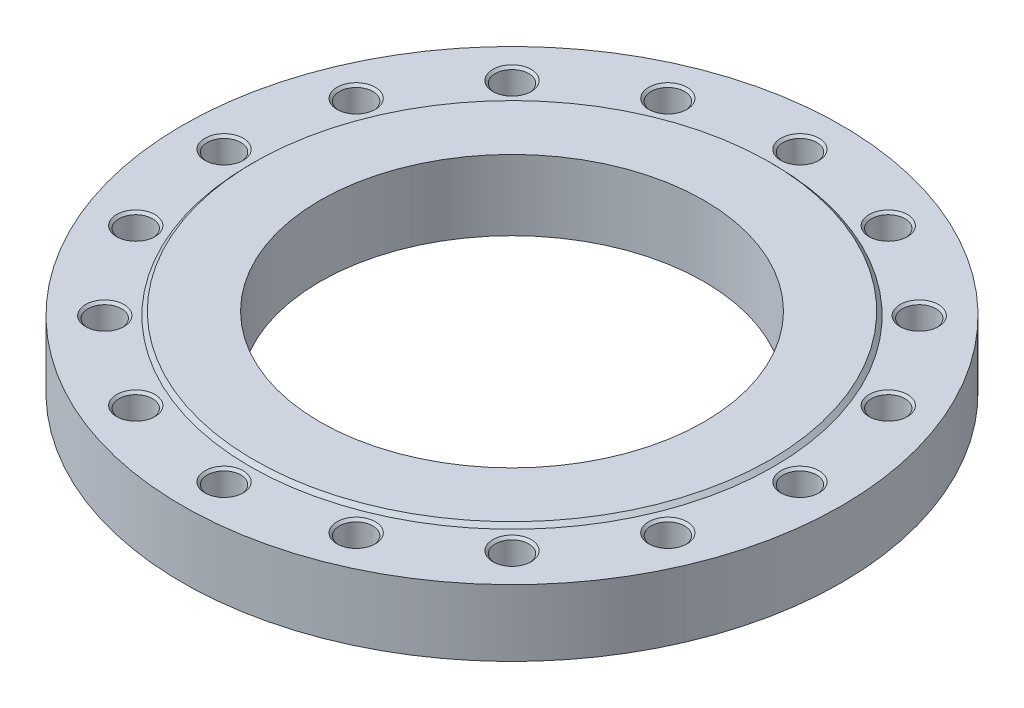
ISO-10303-21;
HEADER;
FILE_DESCRIPTION(('STEP AP214'),'2;1');
FILE_NAME('part.step','',(''),(''),'','','');
FILE_SCHEMA(('AUTOMOTIVE_DESIGN { 1 0 10303 214 1 1 1 1 }'));
ENDSEC;
DATA;
#1=APPLICATION_CONTEXT('core data for automotive mechanical design processes');
#2=APPLICATION_PROTOCOL_DEFINITION('international standard','automotive_design',2000,#1);
#3=PRODUCT_CONTEXT('',#1,'mechanical');
#4=PRODUCT('Part','Part','',(#3));
#5=PRODUCT_RELATED_PRODUCT_CATEGORY('part','',(#4));
#6=PRODUCT_DEFINITION_FORMATION('','',#4);
#7=PRODUCT_DEFINITION_CONTEXT('part definition',#1,'design');
#8=PRODUCT_DEFINITION('design','',#6,#7);
#9=PRODUCT_DEFINITION_SHAPE('','',#8);
#10=(LENGTH_UNIT() NAMED_UNIT(*) SI_UNIT(.MILLI.,.METRE.));
#11=(NAMED_UNIT(*) PLANE_ANGLE_UNIT() SI_UNIT($,.RADIAN.));
#12=(NAMED_UNIT(*) SI_UNIT($,.STERADIAN.) SOLID_ANGLE_UNIT());
#13=UNCERTAINTY_MEASURE_WITH_UNIT(LENGTH_MEASURE(1.E-05),#10,'distance_accuracy_value','');
#14=(GEOMETRIC_REPRESENTATION_CONTEXT(3) GLOBAL_UNCERTAINTY_ASSIGNED_CONTEXT((#13)) GLOBAL_UNIT_ASSIGNED_CONTEXT((#10,
#11,#12)) REPRESENTATION_CONTEXT('',''));
#15=CARTESIAN_POINT('',(0.,0.,0.));
#16=DIRECTION('',(0.,0.,1.));
#17=DIRECTION('',(1.,0.,0.));
#18=AXIS2_PLACEMENT_3D('',#15,#16,#17);
#19=CARTESIAN_POINT('',(0.,26.,0.));
#20=DIRECTION('',(0.,-1.,0.));
#21=DIRECTION('',(1.,0.,0.));
#22=AXIS2_PLACEMENT_3D('',#19,#20,#21);
#23=CYLINDRICAL_SURFACE('',#22,257.5);
#24=CARTESIAN_POINT('',(0.,0.,0.));
#25=DIRECTION('',(0.,1.,0.));
#26=DIRECTION('',(1.,0.,0.));
#27=AXIS2_PLACEMENT_3D('',#24,#25,#26);
#28=CIRCLE('',#27,257.5);
#29=CARTESIAN_POINT('',(257.5,0.,0.));
#30=VERTEX_POINT('',#29);
#31=EDGE_CURVE('E9',#30,#30,#28,.T.);
#32=ORIENTED_EDGE('',*,*,#31,.T.);
#33=EDGE_LOOP('',(#32));
#34=FACE_BOUND('',#33,.T.);
#35=CARTESIAN_POINT('',(0.,52.,0.));
#36=DIRECTION('',(0.,1.,0.));
#37=DIRECTION('',(1.,0.,0.));
#38=AXIS2_PLACEMENT_3D('',#35,#36,#37);
#39=CIRCLE('',#38,257.5);
#40=CARTESIAN_POINT('',(257.5,52.,0.));
#41=VERTEX_POINT('',#40);
#42=EDGE_CURVE('E159',#41,#41,#39,.T.);
#43=ORIENTED_EDGE('',*,*,#42,.F.);
#44=EDGE_LOOP('',(#43));
#45=FACE_BOUND('',#44,.T.);
#46=ADVANCED_FACE('F15',(#34,#45),#23,.T.);
#47=CARTESIAN_POINT('',(203.75,0.,0.));
#48=DIRECTION('',(0.,-1.,0.));
#49=DIRECTION('',(-1.,0.,0.));
#50=AXIS2_PLACEMENT_3D('',#47,#48,#49);
#51=PLANE('',#50);
#52=CARTESIAN_POINT('',(0.,0.,0.));
#53=DIRECTION('',(0.,1.,0.));
#54=DIRECTION('',(1.,0.,0.));
#55=AXIS2_PLACEMENT_3D('',#52,#53,#54);
#56=CIRCLE('',#55,150.);
#57=CARTESIAN_POINT('',(150.,0.,0.));
#58=VERTEX_POINT('',#57);
#59=EDGE_CURVE('E23',#58,#58,#56,.T.);
#60=ORIENTED_EDGE('',*,*,#59,.T.);
#61=EDGE_LOOP('',(#60));
#62=FACE_BOUND('',#61,.T.);
#63=ORIENTED_EDGE('',*,*,#31,.F.);
#64=EDGE_LOOP('',(#63));
#65=FACE_BOUND('',#64,.T.);
#66=ADVANCED_FACE('F413',(#62,#65),#51,.T.);
#67=CARTESIAN_POINT('',(0.,27.5,0.));
#68=DIRECTION('',(0.,-1.,0.));
#69=DIRECTION('',(1.,0.,0.));
#70=AXIS2_PLACEMENT_3D('',#67,#68,#69);
#71=CYLINDRICAL_SURFACE('',#70,150.);
#72=CARTESIAN_POINT('',(0.,55.,0.));
#73=DIRECTION('',(0.,1.,0.));
#74=DIRECTION('',(1.,0.,0.));
#75=AXIS2_PLACEMENT_3D('',#72,#73,#74);
#76=CIRCLE('',#75,150.);
#77=CARTESIAN_POINT('',(150.,55.,0.));
#78=VERTEX_POINT('',#77);
#79=EDGE_CURVE('E341',#78,#78,#76,.T.);
#80=ORIENTED_EDGE('',*,*,#79,.T.);
#81=EDGE_LOOP('',(#80));
#82=FACE_BOUND('',#81,.T.);
#83=ORIENTED_EDGE('',*,*,#59,.F.);
#84=EDGE_LOOP('',(#83));
#85=FACE_BOUND('',#84,.T.);
#86=ADVANCED_FACE('F417',(#82,#85),#71,.F.);
#87=CARTESIAN_POINT('',(175.75,55.,0.));
#88=DIRECTION('',(0.,1.,0.));
#89=DIRECTION('',(1.,0.,0.));
#90=AXIS2_PLACEMENT_3D('',#87,#88,#89);
#91=PLANE('',#90);
#92=CARTESIAN_POINT('',(0.,55.,0.));
#93=DIRECTION('',(0.,1.,0.));
#94=DIRECTION('',(1.,0.,0.));
#95=AXIS2_PLACEMENT_3D('',#92,#93,#94);
#96=CIRCLE('',#95,201.5);
#97=CARTESIAN_POINT('',(201.5,55.,0.));
#98=VERTEX_POINT('',#97);
#99=EDGE_CURVE('E164',#98,#98,#96,.T.);
#100=ORIENTED_EDGE('',*,*,#99,.T.);
#101=EDGE_LOOP('',(#100));
#102=FACE_BOUND('',#101,.T.);
#103=ORIENTED_EDGE('',*,*,#79,.F.);
#104=EDGE_LOOP('',(#103));
#105=FACE_BOUND('',#104,.T.);
#106=ADVANCED_FACE('F424',(#102,#105),#91,.T.);
#107=CARTESIAN_POINT('',(0.,53.5,0.));
#108=DIRECTION('',(0.,-1.,0.));
#109=DIRECTION('',(1.,0.,0.));
#110=AXIS2_PLACEMENT_3D('',#107,#108,#109);
#111=CONICAL_SURFACE('',#110,203.,0.785398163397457);
#112=CARTESIAN_POINT('',(0.,52.,0.));
#113=DIRECTION('',(0.,1.,0.));
#114=DIRECTION('',(1.,0.,0.));
#115=AXIS2_PLACEMENT_3D('',#112,#113,#114);
#116=CIRCLE('',#115,204.5);
#117=CARTESIAN_POINT('',(204.5,52.,0.));
#118=VERTEX_POINT('',#117);
#119=EDGE_CURVE('E348',#118,#118,#116,.T.);
#120=ORIENTED_EDGE('',*,*,#119,.T.);
#121=EDGE_LOOP('',(#120));
#122=FACE_BOUND('',#121,.T.);
#123=ORIENTED_EDGE('',*,*,#99,.F.);
#124=EDGE_LOOP('',(#123));
#125=FACE_BOUND('',#124,.T.);
#126=ADVANCED_FACE('F410',(#122,#125),#111,.T.);
#127=CARTESIAN_POINT('',(231.,52.,0.));
#128=DIRECTION('',(0.,1.,0.));
#129=DIRECTION('',(1.,0.,0.));
#130=AXIS2_PLACEMENT_3D('',#127,#128,#129);
#131=PLANE('',#130);
#132=ORIENTED_EDGE('',*,*,#42,.T.);
#133=EDGE_LOOP('',(#132));
#134=FACE_BOUND('',#133,.T.);
#135=ORIENTED_EDGE('',*,*,#119,.F.);
#136=EDGE_LOOP('',(#135));
#137=FACE_BOUND('',#136,.T.);
#138=CARTESIAN_POINT('',(225.,52.,0.));
#139=DIRECTION('',(0.,-1.,0.));
#140=DIRECTION('',(1.,0.,0.));
#141=AXIS2_PLACEMENT_3D('',#138,#139,#140);
#142=CIRCLE('',#141,15.);
#143=CARTESIAN_POINT('',(240.,52.,0.));
#144=VERTEX_POINT('',#143);
#145=EDGE_CURVE('E222',#144,#144,#142,.T.);
#146=ORIENTED_EDGE('',*,*,#145,.T.);
#147=EDGE_LOOP('',(#146));
#148=FACE_BOUND('',#147,.T.);
#149=CARTESIAN_POINT('',(207.87289481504,52.,-86.1037722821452));
#150=DIRECTION('',(0.,-1.,0.));
#151=DIRECTION('',(0.923879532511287,0.,-0.38268343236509));
#152=AXIS2_PLACEMENT_3D('',#149,#150,#151);
#153=CIRCLE('',#152,15.);
#154=CARTESIAN_POINT('',(221.731087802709,52.,-91.8440237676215));
#155=VERTEX_POINT('',#154);
#156=EDGE_CURVE('E337',#155,#155,#153,.T.);
#157=ORIENTED_EDGE('',*,*,#156,.T.);
#158=EDGE_LOOP('',(#157));
#159=FACE_BOUND('',#158,.T.);
#160=CARTESIAN_POINT('',(159.099025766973,52.,-159.099025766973));
#161=DIRECTION('',(0.,-1.,0.));
#162=DIRECTION('',(0.707106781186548,0.,-0.707106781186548));
#163=AXIS2_PLACEMENT_3D('',#160,#161,#162);
#164=CIRCLE('',#163,15.);
#165=CARTESIAN_POINT('',(169.705627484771,52.,-169.705627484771));
#166=VERTEX_POINT('',#165);
#167=EDGE_CURVE('E373',#166,#166,#164,.T.);
#168=ORIENTED_EDGE('',*,*,#167,.T.);
#169=EDGE_LOOP('',(#168));
#170=FACE_BOUND('',#169,.T.);
#171=CARTESIAN_POINT('',(86.1037722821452,52.,-207.87289481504));
#172=DIRECTION('',(0.,-1.,0.));
#173=DIRECTION('',(0.38268343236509,0.,-0.923879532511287));
#174=AXIS2_PLACEMENT_3D('',#171,#172,#173);
#175=CIRCLE('',#174,15.);
#176=CARTESIAN_POINT('',(91.8440237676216,52.,-221.731087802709));
#177=VERTEX_POINT('',#176);
#178=EDGE_CURVE('E364',#177,#177,#175,.T.);
#179=ORIENTED_EDGE('',*,*,#178,.T.);
#180=EDGE_LOOP('',(#179));
#181=FACE_BOUND('',#180,.T.);
#182=CARTESIAN_POINT('',(0.,52.,-225.));
#183=DIRECTION('',(0.,-1.,0.));
#184=DIRECTION('',(0.,0.,-1.));
#185=AXIS2_PLACEMENT_3D('',#182,#183,#184);
#186=CIRCLE('',#185,15.);
#187=CARTESIAN_POINT('',(0.,52.,-240.));
#188=VERTEX_POINT('',#187);
#189=EDGE_CURVE('E186',#188,#188,#186,.T.);
#190=ORIENTED_EDGE('',*,*,#189,.T.);
#191=EDGE_LOOP('',(#190));
#192=FACE_BOUND('',#191,.T.);
#193=CARTESIAN_POINT('',(-86.1037722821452,52.,-207.87289481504));
#194=DIRECTION('',(0.,-1.,0.));
#195=DIRECTION('',(-0.38268343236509,0.,-0.923879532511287));
#196=AXIS2_PLACEMENT_3D('',#193,#194,#195);
#197=CIRCLE('',#196,15.);
#198=CARTESIAN_POINT('',(-91.8440237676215,52.,-221.731087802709));
#199=VERTEX_POINT('',#198);
#200=EDGE_CURVE('E251',#199,#199,#197,.T.);
#201=ORIENTED_EDGE('',*,*,#200,.T.);
#202=EDGE_LOOP('',(#201));
#203=FACE_BOUND('',#202,.T.);
#204=CARTESIAN_POINT('',(-159.099025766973,52.,-159.099025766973));
#205=DIRECTION('',(0.,-1.,0.));
#206=DIRECTION('',(-0.707106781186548,0.,-0.707106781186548));
#207=AXIS2_PLACEMENT_3D('',#204,#205,#206);
#208=CIRCLE('',#207,15.);
#209=CARTESIAN_POINT('',(-169.705627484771,52.,-169.705627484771));
#210=VERTEX_POINT('',#209);
#211=EDGE_CURVE('E335',#210,#210,#208,.T.);
#212=ORIENTED_EDGE('',*,*,#211,.T.);
#213=EDGE_LOOP('',(#212));
#214=FACE_BOUND('',#213,.T.);
#215=CARTESIAN_POINT('',(-207.87289481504,52.,-86.1037722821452));
#216=DIRECTION('',(0.,-1.,0.));
#217=DIRECTION('',(-0.923879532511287,0.,-0.38268343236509));
#218=AXIS2_PLACEMENT_3D('',#215,#216,#217);
#219=CIRCLE('',#218,15.);
#220=CARTESIAN_POINT('',(-221.731087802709,52.,-91.8440237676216));
#221=VERTEX_POINT('',#220);
#222=EDGE_CURVE('E321',#221,#221,#219,.T.);
#223=ORIENTED_EDGE('',*,*,#222,.T.);
#224=EDGE_LOOP('',(#223));
#225=FACE_BOUND('',#224,.T.);
#226=CARTESIAN_POINT('',(-225.,52.,0.));
#227=DIRECTION('',(0.,-1.,0.));
#228=DIRECTION('',(-1.,0.,0.));
#229=AXIS2_PLACEMENT_3D('',#226,#227,#228);
#230=CIRCLE('',#229,15.);
#231=CARTESIAN_POINT('',(-240.,52.,0.));
#232=VERTEX_POINT('',#231);
#233=EDGE_CURVE('E259',#232,#232,#230,.T.);
#234=ORIENTED_EDGE('',*,*,#233,.T.);
#235=EDGE_LOOP('',(#234));
#236=FACE_BOUND('',#235,.T.);
#237=CARTESIAN_POINT('',(-207.87289481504,52.,86.1037722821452));
#238=DIRECTION('',(0.,-1.,0.));
#239=DIRECTION('',(-0.923879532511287,0.,0.38268343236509));
#240=AXIS2_PLACEMENT_3D('',#237,#238,#239);
#241=CIRCLE('',#240,15.);
#242=CARTESIAN_POINT('',(-221.731087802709,52.,91.8440237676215));
#243=VERTEX_POINT('',#242);
#244=EDGE_CURVE('E214',#243,#243,#241,.T.);
#245=ORIENTED_EDGE('',*,*,#244,.T.);
#246=EDGE_LOOP('',(#245));
#247=FACE_BOUND('',#246,.T.);
#248=CARTESIAN_POINT('',(-159.099025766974,52.,159.099025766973));
#249=DIRECTION('',(0.,-1.,0.));
#250=DIRECTION('',(-0.707106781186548,0.,0.707106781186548));
#251=AXIS2_PLACEMENT_3D('',#248,#249,#250);
#252=CIRCLE('',#251,15.);
#253=CARTESIAN_POINT('',(-169.705627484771,52.,169.705627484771));
#254=VERTEX_POINT('',#253);
#255=EDGE_CURVE('E287',#254,#254,#252,.T.);
#256=ORIENTED_EDGE('',*,*,#255,.T.);
#257=EDGE_LOOP('',(#256));
#258=FACE_BOUND('',#257,.T.);
#259=CARTESIAN_POINT('',(-86.1037722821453,52.,207.87289481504));
#260=DIRECTION('',(0.,-1.,0.));
#261=DIRECTION('',(-0.382683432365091,0.,0.923879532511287));
#262=AXIS2_PLACEMENT_3D('',#259,#260,#261);
#263=CIRCLE('',#262,15.);
#264=CARTESIAN_POINT('',(-91.8440237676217,52.,221.731087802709));
#265=VERTEX_POINT('',#264);
#266=EDGE_CURVE('E258',#265,#265,#263,.T.);
#267=ORIENTED_EDGE('',*,*,#266,.T.);
#268=EDGE_LOOP('',(#267));
#269=FACE_BOUND('',#268,.T.);
#270=CARTESIAN_POINT('',(0.,52.,225.));
#271=DIRECTION('',(0.,-1.,0.));
#272=DIRECTION('',(0.,0.,1.));
#273=AXIS2_PLACEMENT_3D('',#270,#271,#272);
#274=CIRCLE('',#273,15.);
#275=CARTESIAN_POINT('',(0.,52.,240.));
#276=VERTEX_POINT('',#275);
#277=EDGE_CURVE('E218',#276,#276,#274,.T.);
#278=ORIENTED_EDGE('',*,*,#277,.T.);
#279=EDGE_LOOP('',(#278));
#280=FACE_BOUND('',#279,.T.);
#281=CARTESIAN_POINT('',(86.1037722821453,52.,207.87289481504));
#282=DIRECTION('',(0.,-1.,0.));
#283=DIRECTION('',(0.38268343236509,0.,0.923879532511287));
#284=AXIS2_PLACEMENT_3D('',#281,#282,#283);
#285=CIRCLE('',#284,15.);
#286=CARTESIAN_POINT('',(91.8440237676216,52.,221.731087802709));
#287=VERTEX_POINT('',#286);
#288=EDGE_CURVE('E821',#287,#287,#285,.T.);
#289=ORIENTED_EDGE('',*,*,#288,.T.);
#290=EDGE_LOOP('',(#289));
#291=FACE_BOUND('',#290,.T.);
#292=CARTESIAN_POINT('',(159.099025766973,52.,159.099025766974));
#293=DIRECTION('',(0.,-1.,0.));
#294=DIRECTION('',(0.707106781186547,0.,0.707106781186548));
#295=AXIS2_PLACEMENT_3D('',#292,#293,#294);
#296=CIRCLE('',#295,15.);
#297=CARTESIAN_POINT('',(169.705627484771,52.,169.705627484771));
#298=VERTEX_POINT('',#297);
#299=EDGE_CURVE('E804',#298,#298,#296,.T.);
#300=ORIENTED_EDGE('',*,*,#299,.T.);
#301=EDGE_LOOP('',(#300));
#302=FACE_BOUND('',#301,.T.);
#303=CARTESIAN_POINT('',(207.87289481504,52.,86.1037722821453));
#304=DIRECTION('',(0.,-1.,0.));
#305=DIRECTION('',(0.923879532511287,0.,0.382683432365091));
#306=AXIS2_PLACEMENT_3D('',#303,#304,#305);
#307=CIRCLE('',#306,15.);
#308=CARTESIAN_POINT('',(221.731087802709,52.,91.8440237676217));
#309=VERTEX_POINT('',#308);
#310=EDGE_CURVE('E815',#309,#309,#307,.T.);
#311=ORIENTED_EDGE('',*,*,#310,.T.);
#312=EDGE_LOOP('',(#311));
#313=FACE_BOUND('',#312,.T.);
#314=ADVANCED_FACE('F187',(#134,#137,#148,#159,#170,#181,#192,#203,#214,#225,#236,#247,#258,
#269,#280,#291,#302,#313),#131,.T.);
#315=CARTESIAN_POINT('',(225.,8.21673193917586,0.));
#316=DIRECTION('',(0.,1.,0.));
#317=DIRECTION('',(1.,0.,0.));
#318=AXIS2_PLACEMENT_3D('',#315,#316,#317);
#319=CONICAL_SURFACE('',#318,6.5528125,1.0471975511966);
#320=CARTESIAN_POINT('',(225.,12.,0.));
#321=DIRECTION('',(0.,-1.,0.));
#322=DIRECTION('',(1.,0.,0.));
#323=AXIS2_PLACEMENT_3D('',#320,#321,#322);
#324=CIRCLE('',#323,13.105625);
#325=CARTESIAN_POINT('',(238.105625,12.,0.));
#326=VERTEX_POINT('',#325);
#327=EDGE_CURVE('E350',#326,#326,#324,.T.);
#328=ORIENTED_EDGE('',*,*,#327,.F.);
#329=EDGE_LOOP('',(#328));
#330=FACE_BOUND('',#329,.T.);
#331=CARTESIAN_POINT('',(225.,4.43346387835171,0.));
#332=VERTEX_POINT('',#331);
#333=VERTEX_LOOP('',#332);
#334=FACE_BOUND('',#333,.T.);
#335=ADVANCED_FACE('F398',(#330,#334),#319,.F.);
#336=CARTESIAN_POINT('',(225.,16.0528125,0.));
#337=DIRECTION('',(0.,1.,0.));
#338=DIRECTION('',(1.,0.,0.));
#339=AXIS2_PLACEMENT_3D('',#336,#337,#338);
#340=CYLINDRICAL_SURFACE('',#339,13.105625);
#341=CARTESIAN_POINT('',(225.,20.105625,0.));
#342=DIRECTION('',(0.,-1.,0.));
#343=DIRECTION('',(1.,0.,0.));
#344=AXIS2_PLACEMENT_3D('',#341,#342,#343);
#345=CIRCLE('',#344,13.105625);
#346=CARTESIAN_POINT('',(238.105625,20.105625,0.));
#347=VERTEX_POINT('',#346);
#348=EDGE_CURVE('E313',#347,#347,#345,.T.);
#349=ORIENTED_EDGE('',*,*,#348,.F.);
#350=EDGE_LOOP('',(#349));
#351=FACE_BOUND('',#350,.T.);
#352=ORIENTED_EDGE('',*,*,#327,.T.);
#353=EDGE_LOOP('',(#352));
#354=FACE_BOUND('',#353,.T.);
#355=ADVANCED_FACE('F395',(#351,#354),#340,.F.);
#356=CARTESIAN_POINT('',(225.,21.0528125,0.));
#357=DIRECTION('',(0.,1.,0.));
#358=DIRECTION('',(1.,0.,0.));
#359=AXIS2_PLACEMENT_3D('',#356,#357,#358);
#360=CONICAL_SURFACE('',#359,14.0528125,0.785398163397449);
#361=CARTESIAN_POINT('',(225.,22.,0.));
#362=DIRECTION('',(0.,-1.,0.));
#363=DIRECTION('',(1.,0.,0.));
#364=AXIS2_PLACEMENT_3D('',#361,#362,#363);
#365=CIRCLE('',#364,15.);
#366=CARTESIAN_POINT('',(240.,22.,0.));
#367=VERTEX_POINT('',#366);
#368=EDGE_CURVE('E221',#367,#367,#365,.T.);
#369=ORIENTED_EDGE('',*,*,#368,.F.);
#370=EDGE_LOOP('',(#369));
#371=FACE_BOUND('',#370,.T.);
#372=ORIENTED_EDGE('',*,*,#348,.T.);
#373=EDGE_LOOP('',(#372));
#374=FACE_BOUND('',#373,.T.);
#375=ADVANCED_FACE('F407',(#371,#374),#360,.F.);
#376=CARTESIAN_POINT('',(239.0528125,22.,0.));
#377=DIRECTION('',(0.,1.,0.));
#378=DIRECTION('',(-1.,0.,0.));
#379=AXIS2_PLACEMENT_3D('',#376,#377,#378);
#380=PLANE('',#379);
#381=CARTESIAN_POINT('',(225.,22.,0.));
#382=DIRECTION('',(0.,-1.,0.));
#383=DIRECTION('',(1.,0.,0.));
#384=AXIS2_PLACEMENT_3D('',#381,#382,#383);
#385=CIRCLE('',#384,13.105625);
#386=CARTESIAN_POINT('',(238.105625,22.,0.));
#387=VERTEX_POINT('',#386);
#388=EDGE_CURVE('E219',#387,#387,#385,.T.);
#389=ORIENTED_EDGE('',*,*,#388,.F.);
#390=EDGE_LOOP('',(#389));
#391=FACE_BOUND('',#390,.T.);
#392=ORIENTED_EDGE('',*,*,#368,.T.);
#393=EDGE_LOOP('',(#392));
#394=FACE_BOUND('',#393,.T.);
#395=ADVANCED_FACE('F500',(#391,#394),#380,.F.);
#396=CARTESIAN_POINT('',(225.,36.0528125,0.));
#397=DIRECTION('',(0.,1.,0.));
#398=DIRECTION('',(1.,0.,0.));
#399=AXIS2_PLACEMENT_3D('',#396,#397,#398);
#400=CYLINDRICAL_SURFACE('',#399,13.105625);
#401=CARTESIAN_POINT('',(225.,50.105625,0.));
#402=DIRECTION('',(0.,-1.,0.));
#403=DIRECTION('',(1.,0.,0.));
#404=AXIS2_PLACEMENT_3D('',#401,#402,#403);
#405=CIRCLE('',#404,13.105625);
#406=CARTESIAN_POINT('',(238.105625,50.105625,0.));
#407=VERTEX_POINT('',#406);
#408=EDGE_CURVE('E386',#407,#407,#405,.T.);
#409=ORIENTED_EDGE('',*,*,#408,.F.);
#410=EDGE_LOOP('',(#409));
#411=FACE_BOUND('',#410,.T.);
#412=ORIENTED_EDGE('',*,*,#388,.T.);
#413=EDGE_LOOP('',(#412));
#414=FACE_BOUND('',#413,.T.);
#415=ADVANCED_FACE('F628',(#411,#414),#400,.F.);
#416=CARTESIAN_POINT('',(225.,51.0528125,0.));
#417=DIRECTION('',(0.,1.,0.));
#418=DIRECTION('',(1.,0.,0.));
#419=AXIS2_PLACEMENT_3D('',#416,#417,#418);
#420=CONICAL_SURFACE('',#419,14.0528125,0.785398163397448);
#421=ORIENTED_EDGE('',*,*,#145,.F.);
#422=EDGE_LOOP('',(#421));
#423=FACE_BOUND('',#422,.T.);
#424=ORIENTED_EDGE('',*,*,#408,.T.);
#425=EDGE_LOOP('',(#424));
#426=FACE_BOUND('',#425,.T.);
#427=ADVANCED_FACE('F625',(#423,#426),#420,.F.);
#428=CARTESIAN_POINT('',(207.87289481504,8.21673193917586,-86.1037722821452));
#429=DIRECTION('',(0.,1.,0.));
#430=DIRECTION('',(0.923879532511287,0.,-0.38268343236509));
#431=AXIS2_PLACEMENT_3D('',#428,#429,#430);
#432=CONICAL_SURFACE('',#431,6.5528125,1.0471975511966);
#433=CARTESIAN_POINT('',(207.87289481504,12.,-86.1037722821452));
#434=DIRECTION('',(0.,-1.,0.));
#435=DIRECTION('',(0.923879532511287,0.,-0.38268343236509));
#436=AXIS2_PLACEMENT_3D('',#433,#434,#435);
#437=CIRCLE('',#436,13.105625);
#438=CARTESIAN_POINT('',(219.980913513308,12.,-91.1190778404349));
#439=VERTEX_POINT('',#438);
#440=EDGE_CURVE('E383',#439,#439,#437,.T.);
#441=ORIENTED_EDGE('',*,*,#440,.F.);
#442=EDGE_LOOP('',(#441));
#443=FACE_BOUND('',#442,.T.);
#444=CARTESIAN_POINT('',(207.87289481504,4.43346387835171,-86.1037722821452));
#445=VERTEX_POINT('',#444);
#446=VERTEX_LOOP('',#445);
#447=FACE_BOUND('',#446,.T.);
#448=ADVANCED_FACE('F479',(#443,#447),#432,.F.);
#449=CARTESIAN_POINT('',(207.87289481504,16.0528125,-86.1037722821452));
#450=DIRECTION('',(0.,1.,0.));
#451=DIRECTION('',(0.923879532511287,0.,-0.38268343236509));
#452=AXIS2_PLACEMENT_3D('',#449,#450,#451);
#453=CYLINDRICAL_SURFACE('',#452,13.105625);
#454=CARTESIAN_POINT('',(207.87289481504,20.105625,-86.1037722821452));
#455=DIRECTION('',(0.,-1.,0.));
#456=DIRECTION('',(0.923879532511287,0.,-0.38268343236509));
#457=AXIS2_PLACEMENT_3D('',#454,#455,#456);
#458=CIRCLE('',#457,13.105625);
#459=CARTESIAN_POINT('',(219.980913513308,20.105625,-91.1190778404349));
#460=VERTEX_POINT('',#459);
#461=EDGE_CURVE('E382',#460,#460,#458,.T.);
#462=ORIENTED_EDGE('',*,*,#461,.F.);
#463=EDGE_LOOP('',(#462));
#464=FACE_BOUND('',#463,.T.);
#465=ORIENTED_EDGE('',*,*,#440,.T.);
#466=EDGE_LOOP('',(#465));
#467=FACE_BOUND('',#466,.T.);
#468=ADVANCED_FACE('F476',(#464,#467),#453,.F.);
#469=CARTESIAN_POINT('',(207.87289481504,21.0528125,-86.1037722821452));
#470=DIRECTION('',(0.,1.,0.));
#471=DIRECTION('',(0.923879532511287,0.,-0.38268343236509));
#472=AXIS2_PLACEMENT_3D('',#469,#470,#471);
#473=CONICAL_SURFACE('',#472,14.0528125,0.785398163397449);
#474=CARTESIAN_POINT('',(207.87289481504,22.,-86.1037722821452));
#475=DIRECTION('',(0.,-1.,0.));
#476=DIRECTION('',(0.923879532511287,0.,-0.38268343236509));
#477=AXIS2_PLACEMENT_3D('',#474,#475,#476);
#478=CIRCLE('',#477,15.);
#479=CARTESIAN_POINT('',(221.731087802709,22.,-91.8440237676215));
#480=VERTEX_POINT('',#479);
#481=EDGE_CURVE('E379',#480,#480,#478,.T.);
#482=ORIENTED_EDGE('',*,*,#481,.F.);
#483=EDGE_LOOP('',(#482));
#484=FACE_BOUND('',#483,.T.);
#485=ORIENTED_EDGE('',*,*,#461,.T.);
#486=EDGE_LOOP('',(#485));
#487=FACE_BOUND('',#486,.T.);
#488=ADVANCED_FACE('F451',(#484,#487),#473,.F.);
#489=CARTESIAN_POINT('',(220.856000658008,22.,-91.4815508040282));
#490=DIRECTION('',(0.,1.,0.));
#491=DIRECTION('',(-0.923879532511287,0.,0.38268343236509));
#492=AXIS2_PLACEMENT_3D('',#489,#490,#491);
#493=PLANE('',#492);
#494=CARTESIAN_POINT('',(207.87289481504,22.,-86.1037722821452));
#495=DIRECTION('',(0.,-1.,0.));
#496=DIRECTION('',(0.923879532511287,0.,-0.38268343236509));
#497=AXIS2_PLACEMENT_3D('',#494,#495,#496);
#498=CIRCLE('',#497,13.105625);
#499=CARTESIAN_POINT('',(219.980913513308,22.,-91.1190778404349));
#500=VERTEX_POINT('',#499);
#501=EDGE_CURVE('E339',#500,#500,#498,.T.);
#502=ORIENTED_EDGE('',*,*,#501,.F.);
#503=EDGE_LOOP('',(#502));
#504=FACE_BOUND('',#503,.T.);
#505=ORIENTED_EDGE('',*,*,#481,.T.);
#506=EDGE_LOOP('',(#505));
#507=FACE_BOUND('',#506,.T.);
#508=ADVANCED_FACE('F447',(#504,#507),#493,.F.);
#509=CARTESIAN_POINT('',(207.87289481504,36.0528125,-86.1037722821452));
#510=DIRECTION('',(0.,1.,0.));
#511=DIRECTION('',(0.923879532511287,0.,-0.38268343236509));
#512=AXIS2_PLACEMENT_3D('',#509,#510,#511);
#513=CYLINDRICAL_SURFACE('',#512,13.105625);
#514=CARTESIAN_POINT('',(207.87289481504,50.105625,-86.1037722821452));
#515=DIRECTION('',(0.,-1.,0.));
#516=DIRECTION('',(0.923879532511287,0.,-0.38268343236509));
#517=AXIS2_PLACEMENT_3D('',#514,#515,#516);
#518=CIRCLE('',#517,13.105625);
#519=CARTESIAN_POINT('',(219.980913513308,50.105625,-91.1190778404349));
#520=VERTEX_POINT('',#519);
#521=EDGE_CURVE('E272',#520,#520,#518,.T.);
#522=ORIENTED_EDGE('',*,*,#521,.F.);
#523=EDGE_LOOP('',(#522));
#524=FACE_BOUND('',#523,.T.);
#525=ORIENTED_EDGE('',*,*,#501,.T.);
#526=EDGE_LOOP('',(#525));
#527=FACE_BOUND('',#526,.T.);
#528=ADVANCED_FACE('F450',(#524,#527),#513,.F.);
#529=CARTESIAN_POINT('',(207.87289481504,51.0528125,-86.1037722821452));
#530=DIRECTION('',(0.,1.,0.));
#531=DIRECTION('',(0.923879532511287,0.,-0.38268343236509));
#532=AXIS2_PLACEMENT_3D('',#529,#530,#531);
#533=CONICAL_SURFACE('',#532,14.0528125,0.785398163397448);
#534=ORIENTED_EDGE('',*,*,#156,.F.);
#535=EDGE_LOOP('',(#534));
#536=FACE_BOUND('',#535,.T.);
#537=ORIENTED_EDGE('',*,*,#521,.T.);
#538=EDGE_LOOP('',(#537));
#539=FACE_BOUND('',#538,.T.);
#540=ADVANCED_FACE('F621',(#536,#539),#533,.F.);
#541=CARTESIAN_POINT('',(159.099025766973,8.21673193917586,-159.099025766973));
#542=DIRECTION('',(0.,1.,0.));
#543=DIRECTION('',(0.707106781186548,0.,-0.707106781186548));
#544=AXIS2_PLACEMENT_3D('',#541,#542,#543);
#545=CONICAL_SURFACE('',#544,6.5528125,1.0471975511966);
#546=CARTESIAN_POINT('',(159.099025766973,12.,-159.099025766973));
#547=DIRECTION('',(0.,-1.,0.));
#548=DIRECTION('',(0.707106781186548,0.,-0.707106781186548));
#549=AXIS2_PLACEMENT_3D('',#546,#547,#548);
#550=CIRCLE('',#549,13.105625);
#551=CARTESIAN_POINT('',(168.366102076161,12.,-168.366102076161));
#552=VERTEX_POINT('',#551);
#553=EDGE_CURVE('E269',#552,#552,#550,.T.);
#554=ORIENTED_EDGE('',*,*,#553,.F.);
#555=EDGE_LOOP('',(#554));
#556=FACE_BOUND('',#555,.T.);
#557=CARTESIAN_POINT('',(159.099025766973,4.43346387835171,-159.099025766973));
#558=VERTEX_POINT('',#557);
#559=VERTEX_LOOP('',#558);
#560=FACE_BOUND('',#559,.T.);
#561=ADVANCED_FACE('F619',(#556,#560),#545,.F.);
#562=CARTESIAN_POINT('',(159.099025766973,16.0528125,-159.099025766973));
#563=DIRECTION('',(0.,1.,0.));
#564=DIRECTION('',(0.707106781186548,0.,-0.707106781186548));
#565=AXIS2_PLACEMENT_3D('',#562,#563,#564);
#566=CYLINDRICAL_SURFACE('',#565,13.105625);
#567=CARTESIAN_POINT('',(159.099025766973,20.105625,-159.099025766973));
#568=DIRECTION('',(0.,-1.,0.));
#569=DIRECTION('',(0.707106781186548,0.,-0.707106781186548));
#570=AXIS2_PLACEMENT_3D('',#567,#568,#569);
#571=CIRCLE('',#570,13.105625);
#572=CARTESIAN_POINT('',(168.366102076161,20.105625,-168.366102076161));
#573=VERTEX_POINT('',#572);
#574=EDGE_CURVE('E273',#573,#573,#571,.T.);
#575=ORIENTED_EDGE('',*,*,#574,.F.);
#576=EDGE_LOOP('',(#575));
#577=FACE_BOUND('',#576,.T.);
#578=ORIENTED_EDGE('',*,*,#553,.T.);
#579=EDGE_LOOP('',(#578));
#580=FACE_BOUND('',#579,.T.);
#581=ADVANCED_FACE('F615',(#577,#580),#566,.F.);
#582=CARTESIAN_POINT('',(159.099025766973,21.0528125,-159.099025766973));
#583=DIRECTION('',(0.,1.,0.));
#584=DIRECTION('',(0.707106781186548,0.,-0.707106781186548));
#585=AXIS2_PLACEMENT_3D('',#582,#583,#584);
#586=CONICAL_SURFACE('',#585,14.0528125,0.785398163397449);
#587=CARTESIAN_POINT('',(159.099025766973,22.,-159.099025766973));
#588=DIRECTION('',(0.,-1.,0.));
#589=DIRECTION('',(0.707106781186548,0.,-0.707106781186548));
#590=AXIS2_PLACEMENT_3D('',#587,#588,#589);
#591=CIRCLE('',#590,15.);
#592=CARTESIAN_POINT('',(169.705627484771,22.,-169.705627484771));
#593=VERTEX_POINT('',#592);
#594=EDGE_CURVE('E277',#593,#593,#591,.T.);
#595=ORIENTED_EDGE('',*,*,#594,.F.);
#596=EDGE_LOOP('',(#595));
#597=FACE_BOUND('',#596,.T.);
#598=ORIENTED_EDGE('',*,*,#574,.T.);
#599=EDGE_LOOP('',(#598));
#600=FACE_BOUND('',#599,.T.);
#601=ADVANCED_FACE('F612',(#597,#600),#586,.F.);
#602=CARTESIAN_POINT('',(169.035864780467,22.,-169.035864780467));
#603=DIRECTION('',(0.,1.,0.));
#604=DIRECTION('',(-0.707106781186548,0.,0.707106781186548));
#605=AXIS2_PLACEMENT_3D('',#602,#603,#604);
#606=PLANE('',#605);
#607=CARTESIAN_POINT('',(159.099025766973,22.,-159.099025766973));
#608=DIRECTION('',(0.,-1.,0.));
#609=DIRECTION('',(0.707106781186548,0.,-0.707106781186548));
#610=AXIS2_PLACEMENT_3D('',#607,#608,#609);
#611=CIRCLE('',#610,13.105625);
#612=CARTESIAN_POINT('',(168.366102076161,22.,-168.366102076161));
#613=VERTEX_POINT('',#612);
#614=EDGE_CURVE('E280',#613,#613,#611,.T.);
#615=ORIENTED_EDGE('',*,*,#614,.F.);
#616=EDGE_LOOP('',(#615));
#617=FACE_BOUND('',#616,.T.);
#618=ORIENTED_EDGE('',*,*,#594,.T.);
#619=EDGE_LOOP('',(#618));
#620=FACE_BOUND('',#619,.T.);
#621=ADVANCED_FACE('F441',(#617,#620),#606,.F.);
#622=CARTESIAN_POINT('',(159.099025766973,36.0528125,-159.099025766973));
#623=DIRECTION('',(0.,1.,0.));
#624=DIRECTION('',(0.707106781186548,0.,-0.707106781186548));
#625=AXIS2_PLACEMENT_3D('',#622,#623,#624);
#626=CYLINDRICAL_SURFACE('',#625,13.105625);
#627=CARTESIAN_POINT('',(159.099025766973,50.105625,-159.099025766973));
#628=DIRECTION('',(0.,-1.,0.));
#629=DIRECTION('',(0.707106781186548,0.,-0.707106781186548));
#630=AXIS2_PLACEMENT_3D('',#627,#628,#629);
#631=CIRCLE('',#630,13.105625);
#632=CARTESIAN_POINT('',(168.366102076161,50.105625,-168.366102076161));
#633=VERTEX_POINT('',#632);
#634=EDGE_CURVE('E238',#633,#633,#631,.T.);
#635=ORIENTED_EDGE('',*,*,#634,.F.);
#636=EDGE_LOOP('',(#635));
#637=FACE_BOUND('',#636,.T.);
#638=ORIENTED_EDGE('',*,*,#614,.T.);
#639=EDGE_LOOP('',(#638));
#640=FACE_BOUND('',#639,.T.);
#641=ADVANCED_FACE('F437',(#637,#640),#626,.F.);
#642=CARTESIAN_POINT('',(159.099025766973,51.0528125,-159.099025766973));
#643=DIRECTION('',(0.,1.,0.));
#644=DIRECTION('',(0.707106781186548,0.,-0.707106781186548));
#645=AXIS2_PLACEMENT_3D('',#642,#643,#644);
#646=CONICAL_SURFACE('',#645,14.0528125,0.785398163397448);
#647=ORIENTED_EDGE('',*,*,#167,.F.);
#648=EDGE_LOOP('',(#647));
#649=FACE_BOUND('',#648,.T.);
#650=ORIENTED_EDGE('',*,*,#634,.T.);
#651=EDGE_LOOP('',(#650));
#652=FACE_BOUND('',#651,.T.);
#653=ADVANCED_FACE('F440',(#649,#652),#646,.F.);
#654=CARTESIAN_POINT('',(86.1037722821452,8.21673193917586,-207.87289481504));
#655=DIRECTION('',(0.,1.,0.));
#656=DIRECTION('',(0.38268343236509,0.,-0.923879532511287));
#657=AXIS2_PLACEMENT_3D('',#654,#655,#656);
#658=CONICAL_SURFACE('',#657,6.5528125,1.0471975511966);
#659=CARTESIAN_POINT('',(86.1037722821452,12.,-207.87289481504));
#660=DIRECTION('',(0.,-1.,0.));
#661=DIRECTION('',(0.38268343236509,0.,-0.923879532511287));
#662=AXIS2_PLACEMENT_3D('',#659,#660,#661);
#663=CIRCLE('',#662,13.105625);
#664=CARTESIAN_POINT('',(91.1190778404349,12.,-219.980913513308));
#665=VERTEX_POINT('',#664);
#666=EDGE_CURVE('E236',#665,#665,#663,.T.);
#667=ORIENTED_EDGE('',*,*,#666,.F.);
#668=EDGE_LOOP('',(#667));
#669=FACE_BOUND('',#668,.T.);
#670=CARTESIAN_POINT('',(86.1037722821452,4.43346387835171,-207.87289481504));
#671=VERTEX_POINT('',#670);
#672=VERTEX_LOOP('',#671);
#673=FACE_BOUND('',#672,.T.);
#674=ADVANCED_FACE('F610',(#669,#673),#658,.F.);
#675=CARTESIAN_POINT('',(86.1037722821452,16.0528125,-207.87289481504));
#676=DIRECTION('',(0.,1.,0.));
#677=DIRECTION('',(0.38268343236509,0.,-0.923879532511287));
#678=AXIS2_PLACEMENT_3D('',#675,#676,#677);
#679=CYLINDRICAL_SURFACE('',#678,13.105625);
#680=CARTESIAN_POINT('',(86.1037722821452,20.105625,-207.87289481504));
#681=DIRECTION('',(0.,-1.,0.));
#682=DIRECTION('',(0.38268343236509,0.,-0.923879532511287));
#683=AXIS2_PLACEMENT_3D('',#680,#681,#682);
#684=CIRCLE('',#683,13.105625);
#685=CARTESIAN_POINT('',(91.1190778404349,20.105625,-219.980913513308));
#686=VERTEX_POINT('',#685);
#687=EDGE_CURVE('E239',#686,#686,#684,.T.);
#688=ORIENTED_EDGE('',*,*,#687,.F.);
#689=EDGE_LOOP('',(#688));
#690=FACE_BOUND('',#689,.T.);
#691=ORIENTED_EDGE('',*,*,#666,.T.);
#692=EDGE_LOOP('',(#691));
#693=FACE_BOUND('',#692,.T.);
#694=ADVANCED_FACE('F918',(#690,#693),#679,.F.);
#695=CARTESIAN_POINT('',(86.1037722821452,21.0528125,-207.87289481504));
#696=DIRECTION('',(0.,1.,0.));
#697=DIRECTION('',(0.38268343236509,0.,-0.923879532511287));
#698=AXIS2_PLACEMENT_3D('',#695,#696,#697);
#699=CONICAL_SURFACE('',#698,14.0528125,0.785398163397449);
#700=CARTESIAN_POINT('',(86.1037722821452,22.,-207.87289481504));
#701=DIRECTION('',(0.,-1.,0.));
#702=DIRECTION('',(0.38268343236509,0.,-0.923879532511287));
#703=AXIS2_PLACEMENT_3D('',#700,#701,#702);
#704=CIRCLE('',#703,15.);
#705=CARTESIAN_POINT('',(91.8440237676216,22.,-221.731087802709));
#706=VERTEX_POINT('',#705);
#707=EDGE_CURVE('E368',#706,#706,#704,.T.);
#708=ORIENTED_EDGE('',*,*,#707,.F.);
#709=EDGE_LOOP('',(#708));
#710=FACE_BOUND('',#709,.T.);
#711=ORIENTED_EDGE('',*,*,#687,.T.);
#712=EDGE_LOOP('',(#711));
#713=FACE_BOUND('',#712,.T.);
#714=ADVANCED_FACE('F606',(#710,#713),#699,.F.);
#715=CARTESIAN_POINT('',(91.4815508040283,22.,-220.856000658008));
#716=DIRECTION('',(0.,1.,0.));
#717=DIRECTION('',(-0.38268343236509,0.,0.923879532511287));
#718=AXIS2_PLACEMENT_3D('',#715,#716,#717);
#719=PLANE('',#718);
#720=CARTESIAN_POINT('',(86.1037722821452,22.,-207.87289481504));
#721=DIRECTION('',(0.,-1.,0.));
#722=DIRECTION('',(0.38268343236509,0.,-0.923879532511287));
#723=AXIS2_PLACEMENT_3D('',#720,#721,#722);
#724=CIRCLE('',#723,13.105625);
#725=CARTESIAN_POINT('',(91.1190778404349,22.,-219.980913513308));
#726=VERTEX_POINT('',#725);
#727=EDGE_CURVE('E365',#726,#726,#724,.T.);
#728=ORIENTED_EDGE('',*,*,#727,.F.);
#729=EDGE_LOOP('',(#728));
#730=FACE_BOUND('',#729,.T.);
#731=ORIENTED_EDGE('',*,*,#707,.T.);
#732=EDGE_LOOP('',(#731));
#733=FACE_BOUND('',#732,.T.);
#734=ADVANCED_FACE('F602',(#730,#733),#719,.F.);
#735=CARTESIAN_POINT('',(86.1037722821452,36.0528125,-207.87289481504));
#736=DIRECTION('',(0.,1.,0.));
#737=DIRECTION('',(0.38268343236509,0.,-0.923879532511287));
#738=AXIS2_PLACEMENT_3D('',#735,#736,#737);
#739=CYLINDRICAL_SURFACE('',#738,13.105625);
#740=CARTESIAN_POINT('',(86.1037722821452,50.105625,-207.87289481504));
#741=DIRECTION('',(0.,-1.,0.));
#742=DIRECTION('',(0.38268343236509,0.,-0.923879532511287));
#743=AXIS2_PLACEMENT_3D('',#740,#741,#742);
#744=CIRCLE('',#743,13.105625);
#745=CARTESIAN_POINT('',(91.1190778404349,50.105625,-219.980913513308));
#746=VERTEX_POINT('',#745);
#747=EDGE_CURVE('E362',#746,#746,#744,.T.);
#748=ORIENTED_EDGE('',*,*,#747,.F.);
#749=EDGE_LOOP('',(#748));
#750=FACE_BOUND('',#749,.T.);
#751=ORIENTED_EDGE('',*,*,#727,.T.);
#752=EDGE_LOOP('',(#751));
#753=FACE_BOUND('',#752,.T.);
#754=ADVANCED_FACE('F598',(#750,#753),#739,.F.);
#755=CARTESIAN_POINT('',(86.1037722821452,51.0528125,-207.87289481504));
#756=DIRECTION('',(0.,1.,0.));
#757=DIRECTION('',(0.38268343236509,0.,-0.923879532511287));
#758=AXIS2_PLACEMENT_3D('',#755,#756,#757);
#759=CONICAL_SURFACE('',#758,14.0528125,0.785398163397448);
#760=ORIENTED_EDGE('',*,*,#178,.F.);
#761=EDGE_LOOP('',(#760));
#762=FACE_BOUND('',#761,.T.);
#763=ORIENTED_EDGE('',*,*,#747,.T.);
#764=EDGE_LOOP('',(#763));
#765=FACE_BOUND('',#764,.T.);
#766=ADVANCED_FACE('F594',(#762,#765),#759,.F.);
#767=CARTESIAN_POINT('',(0.,8.21673193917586,-225.));
#768=DIRECTION('',(0.,1.,0.));
#769=DIRECTION('',(0.,0.,-1.));
#770=AXIS2_PLACEMENT_3D('',#767,#768,#769);
#771=CONICAL_SURFACE('',#770,6.5528125,1.0471975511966);
#772=CARTESIAN_POINT('',(0.,12.,-225.));
#773=DIRECTION('',(0.,-1.,0.));
#774=DIRECTION('',(0.,0.,-1.));
#775=AXIS2_PLACEMENT_3D('',#772,#773,#774);
#776=CIRCLE('',#775,13.105625);
#777=CARTESIAN_POINT('',(0.,12.,-238.105625));
#778=VERTEX_POINT('',#777);
#779=EDGE_CURVE('E361',#778,#778,#776,.T.);
#780=ORIENTED_EDGE('',*,*,#779,.F.);
#781=EDGE_LOOP('',(#780));
#782=FACE_BOUND('',#781,.T.);
#783=CARTESIAN_POINT('',(0.,4.43346387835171,-225.));
#784=VERTEX_POINT('',#783);
#785=VERTEX_LOOP('',#784);
#786=FACE_BOUND('',#785,.T.);
#787=ADVANCED_FACE('F590',(#782,#786),#771,.F.);
#788=CARTESIAN_POINT('',(0.,16.0528125,-225.));
#789=DIRECTION('',(0.,1.,0.));
#790=DIRECTION('',(0.,0.,-1.));
#791=AXIS2_PLACEMENT_3D('',#788,#789,#790);
#792=CYLINDRICAL_SURFACE('',#791,13.105625);
#793=CARTESIAN_POINT('',(0.,20.105625,-225.));
#794=DIRECTION('',(0.,-1.,0.));
#795=DIRECTION('',(0.,0.,-1.));
#796=AXIS2_PLACEMENT_3D('',#793,#794,#795);
#797=CIRCLE('',#796,13.105625);
#798=CARTESIAN_POINT('',(0.,20.105625,-238.105625));
#799=VERTEX_POINT('',#798);
#800=EDGE_CURVE('E358',#799,#799,#797,.T.);
#801=ORIENTED_EDGE('',*,*,#800,.F.);
#802=EDGE_LOOP('',(#801));
#803=FACE_BOUND('',#802,.T.);
#804=ORIENTED_EDGE('',*,*,#779,.T.);
#805=EDGE_LOOP('',(#804));
#806=FACE_BOUND('',#805,.T.);
#807=ADVANCED_FACE('F586',(#803,#806),#792,.F.);
#808=CARTESIAN_POINT('',(0.,21.0528125,-225.));
#809=DIRECTION('',(0.,1.,0.));
#810=DIRECTION('',(0.,0.,-1.));
#811=AXIS2_PLACEMENT_3D('',#808,#809,#810);
#812=CONICAL_SURFACE('',#811,14.0528125,0.785398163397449);
#813=CARTESIAN_POINT('',(0.,22.,-225.));
#814=DIRECTION('',(0.,-1.,0.));
#815=DIRECTION('',(0.,0.,-1.));
#816=AXIS2_PLACEMENT_3D('',#813,#814,#815);
#817=CIRCLE('',#816,15.);
#818=CARTESIAN_POINT('',(0.,22.,-240.));
#819=VERTEX_POINT('',#818);
#820=EDGE_CURVE('E193',#819,#819,#817,.T.);
#821=ORIENTED_EDGE('',*,*,#820,.F.);
#822=EDGE_LOOP('',(#821));
#823=FACE_BOUND('',#822,.T.);
#824=ORIENTED_EDGE('',*,*,#800,.T.);
#825=EDGE_LOOP('',(#824));
#826=FACE_BOUND('',#825,.T.);
#827=ADVANCED_FACE('F582',(#823,#826),#812,.F.);
#828=CARTESIAN_POINT('',(0.,22.,-239.0528125));
#829=DIRECTION('',(0.,1.,0.));
#830=DIRECTION('',(0.,0.,1.));
#831=AXIS2_PLACEMENT_3D('',#828,#829,#830);
#832=PLANE('',#831);
#833=CARTESIAN_POINT('',(0.,22.,-225.));
#834=DIRECTION('',(0.,-1.,0.));
#835=DIRECTION('',(0.,0.,-1.));
#836=AXIS2_PLACEMENT_3D('',#833,#834,#835);
#837=CIRCLE('',#836,13.105625);
#838=CARTESIAN_POINT('',(0.,22.,-238.105625));
#839=VERTEX_POINT('',#838);
#840=EDGE_CURVE('E190',#839,#839,#837,.T.);
#841=ORIENTED_EDGE('',*,*,#840,.F.);
#842=EDGE_LOOP('',(#841));
#843=FACE_BOUND('',#842,.T.);
#844=ORIENTED_EDGE('',*,*,#820,.T.);
#845=EDGE_LOOP('',(#844));
#846=FACE_BOUND('',#845,.T.);
#847=ADVANCED_FACE('F585',(#843,#846),#832,.F.);
#848=CARTESIAN_POINT('',(0.,36.0528125,-225.));
#849=DIRECTION('',(0.,1.,0.));
#850=DIRECTION('',(0.,0.,-1.));
#851=AXIS2_PLACEMENT_3D('',#848,#849,#850);
#852=CYLINDRICAL_SURFACE('',#851,13.105625);
#853=CARTESIAN_POINT('',(0.,50.105625,-225.));
#854=DIRECTION('',(0.,-1.,0.));
#855=DIRECTION('',(0.,0.,-1.));
#856=AXIS2_PLACEMENT_3D('',#853,#854,#855);
#857=CIRCLE('',#856,13.105625);
#858=CARTESIAN_POINT('',(0.,50.105625,-238.105625));
#859=VERTEX_POINT('',#858);
#860=EDGE_CURVE('E191',#859,#859,#857,.T.);
#861=ORIENTED_EDGE('',*,*,#860,.F.);
#862=EDGE_LOOP('',(#861));
#863=FACE_BOUND('',#862,.T.);
#864=ORIENTED_EDGE('',*,*,#840,.T.);
#865=EDGE_LOOP('',(#864));
#866=FACE_BOUND('',#865,.T.);
#867=ADVANCED_FACE('F522',(#863,#866),#852,.F.);
#868=CARTESIAN_POINT('',(0.,51.0528125,-225.));
#869=DIRECTION('',(0.,1.,0.));
#870=DIRECTION('',(0.,0.,-1.));
#871=AXIS2_PLACEMENT_3D('',#868,#869,#870);
#872=CONICAL_SURFACE('',#871,14.0528125,0.785398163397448);
#873=ORIENTED_EDGE('',*,*,#189,.F.);
#874=EDGE_LOOP('',(#873));
#875=FACE_BOUND('',#874,.T.);
#876=ORIENTED_EDGE('',*,*,#860,.T.);
#877=EDGE_LOOP('',(#876));
#878=FACE_BOUND('',#877,.T.);
#879=ADVANCED_FACE('F518',(#875,#878),#872,.F.);
#880=CARTESIAN_POINT('',(-86.1037722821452,8.21673193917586,-207.87289481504));
#881=DIRECTION('',(0.,1.,0.));
#882=DIRECTION('',(-0.38268343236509,0.,-0.923879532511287));
#883=AXIS2_PLACEMENT_3D('',#880,#881,#882);
#884=CONICAL_SURFACE('',#883,6.5528125,1.0471975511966);
#885=CARTESIAN_POINT('',(-86.1037722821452,12.,-207.87289481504));
#886=DIRECTION('',(0.,-1.,0.));
#887=DIRECTION('',(-0.38268343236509,0.,-0.923879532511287));
#888=AXIS2_PLACEMENT_3D('',#885,#886,#887);
#889=CIRCLE('',#888,13.105625);
#890=CARTESIAN_POINT('',(-91.1190778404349,12.,-219.980913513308));
#891=VERTEX_POINT('',#890);
#892=EDGE_CURVE('E195',#891,#891,#889,.T.);
#893=ORIENTED_EDGE('',*,*,#892,.F.);
#894=EDGE_LOOP('',(#893));
#895=FACE_BOUND('',#894,.T.);
#896=CARTESIAN_POINT('',(-86.1037722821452,4.43346387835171,-207.87289481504));
#897=VERTEX_POINT('',#896);
#898=VERTEX_LOOP('',#897);
#899=FACE_BOUND('',#898,.T.);
#900=ADVANCED_FACE('F521',(#895,#899),#884,.F.);
#901=CARTESIAN_POINT('',(-86.1037722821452,16.0528125,-207.87289481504));
#902=DIRECTION('',(0.,1.,0.));
#903=DIRECTION('',(-0.38268343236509,0.,-0.923879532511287));
#904=AXIS2_PLACEMENT_3D('',#901,#902,#903);
#905=CYLINDRICAL_SURFACE('',#904,13.105625);
#906=CARTESIAN_POINT('',(-86.1037722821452,20.105625,-207.87289481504));
#907=DIRECTION('',(0.,-1.,0.));
#908=DIRECTION('',(-0.38268343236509,0.,-0.923879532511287));
#909=AXIS2_PLACEMENT_3D('',#906,#907,#908);
#910=CIRCLE('',#909,13.105625);
#911=CARTESIAN_POINT('',(-91.1190778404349,20.105625,-219.980913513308));
#912=VERTEX_POINT('',#911);
#913=EDGE_CURVE('E351',#912,#912,#910,.T.);
#914=ORIENTED_EDGE('',*,*,#913,.F.);
#915=EDGE_LOOP('',(#914));
#916=FACE_BOUND('',#915,.T.);
#917=ORIENTED_EDGE('',*,*,#892,.T.);
#918=EDGE_LOOP('',(#917));
#919=FACE_BOUND('',#918,.T.);
#920=ADVANCED_FACE('F575',(#916,#919),#905,.F.);
#921=CARTESIAN_POINT('',(-86.1037722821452,21.0528125,-207.87289481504));
#922=DIRECTION('',(0.,1.,0.));
#923=DIRECTION('',(-0.38268343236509,0.,-0.923879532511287));
#924=AXIS2_PLACEMENT_3D('',#921,#922,#923);
#925=CONICAL_SURFACE('',#924,14.0528125,0.785398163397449);
#926=CARTESIAN_POINT('',(-86.1037722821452,22.,-207.87289481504));
#927=DIRECTION('',(0.,-1.,0.));
#928=DIRECTION('',(-0.38268343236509,0.,-0.923879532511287));
#929=AXIS2_PLACEMENT_3D('',#926,#927,#928);
#930=CIRCLE('',#929,15.);
#931=CARTESIAN_POINT('',(-91.8440237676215,22.,-221.731087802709));
#932=VERTEX_POINT('',#931);
#933=EDGE_CURVE('E354',#932,#932,#930,.T.);
#934=ORIENTED_EDGE('',*,*,#933,.F.);
#935=EDGE_LOOP('',(#934));
#936=FACE_BOUND('',#935,.T.);
#937=ORIENTED_EDGE('',*,*,#913,.T.);
#938=EDGE_LOOP('',(#937));
#939=FACE_BOUND('',#938,.T.);
#940=ADVANCED_FACE('F573',(#936,#939),#925,.F.);
#941=CARTESIAN_POINT('',(-91.4815508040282,22.,-220.856000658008));
#942=DIRECTION('',(0.,1.,0.));
#943=DIRECTION('',(0.38268343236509,0.,0.923879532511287));
#944=AXIS2_PLACEMENT_3D('',#941,#942,#943);
#945=PLANE('',#944);
#946=CARTESIAN_POINT('',(-86.1037722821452,22.,-207.87289481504));
#947=DIRECTION('',(0.,-1.,0.));
#948=DIRECTION('',(-0.38268343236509,0.,-0.923879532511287));
#949=AXIS2_PLACEMENT_3D('',#946,#947,#948);
#950=CIRCLE('',#949,13.105625);
#951=CARTESIAN_POINT('',(-91.1190778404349,22.,-219.980913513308));
#952=VERTEX_POINT('',#951);
#953=EDGE_CURVE('E254',#952,#952,#950,.T.);
#954=ORIENTED_EDGE('',*,*,#953,.F.);
#955=EDGE_LOOP('',(#954));
#956=FACE_BOUND('',#955,.T.);
#957=ORIENTED_EDGE('',*,*,#933,.T.);
#958=EDGE_LOOP('',(#957));
#959=FACE_BOUND('',#958,.T.);
#960=ADVANCED_FACE('F569',(#956,#959),#945,.F.);
#961=CARTESIAN_POINT('',(-86.1037722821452,36.0528125,-207.87289481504));
#962=DIRECTION('',(0.,1.,0.));
#963=DIRECTION('',(-0.38268343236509,0.,-0.923879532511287));
#964=AXIS2_PLACEMENT_3D('',#961,#962,#963);
#965=CYLINDRICAL_SURFACE('',#964,13.105625);
#966=CARTESIAN_POINT('',(-86.1037722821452,50.105625,-207.87289481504));
#967=DIRECTION('',(0.,-1.,0.));
#968=DIRECTION('',(-0.38268343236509,0.,-0.923879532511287));
#969=AXIS2_PLACEMENT_3D('',#966,#967,#968);
#970=CIRCLE('',#969,13.105625);
#971=CARTESIAN_POINT('',(-91.1190778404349,50.105625,-219.980913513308));
#972=VERTEX_POINT('',#971);
#973=EDGE_CURVE('E255',#972,#972,#970,.T.);
#974=ORIENTED_EDGE('',*,*,#973,.F.);
#975=EDGE_LOOP('',(#974));
#976=FACE_BOUND('',#975,.T.);
#977=ORIENTED_EDGE('',*,*,#953,.T.);
#978=EDGE_LOOP('',(#977));
#979=FACE_BOUND('',#978,.T.);
#980=ADVANCED_FACE('F566',(#976,#979),#965,.F.);
#981=CARTESIAN_POINT('',(-86.1037722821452,51.0528125,-207.87289481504));
#982=DIRECTION('',(0.,1.,0.));
#983=DIRECTION('',(-0.38268343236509,0.,-0.923879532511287));
#984=AXIS2_PLACEMENT_3D('',#981,#982,#983);
#985=CONICAL_SURFACE('',#984,14.0528125,0.785398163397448);
#986=ORIENTED_EDGE('',*,*,#200,.F.);
#987=EDGE_LOOP('',(#986));
#988=FACE_BOUND('',#987,.T.);
#989=ORIENTED_EDGE('',*,*,#973,.T.);
#990=EDGE_LOOP('',(#989));
#991=FACE_BOUND('',#990,.T.);
#992=ADVANCED_FACE('F564',(#988,#991),#985,.F.);
#993=CARTESIAN_POINT('',(-159.099025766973,8.21673193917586,-159.099025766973));
#994=DIRECTION('',(0.,1.,0.));
#995=DIRECTION('',(-0.707106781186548,0.,-0.707106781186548));
#996=AXIS2_PLACEMENT_3D('',#993,#994,#995);
#997=CONICAL_SURFACE('',#996,6.5528125,1.0471975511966);
#998=CARTESIAN_POINT('',(-159.099025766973,12.,-159.099025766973));
#999=DIRECTION('',(0.,-1.,0.));
#1000=DIRECTION('',(-0.707106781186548,0.,-0.707106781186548));
#1001=AXIS2_PLACEMENT_3D('',#998,#999,#1000);
#1002=CIRCLE('',#1001,13.105625);
#1003=CARTESIAN_POINT('',(-168.366102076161,12.,-168.366102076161));
#1004=VERTEX_POINT('',#1003);
#1005=EDGE_CURVE('E345',#1004,#1004,#1002,.T.);
#1006=ORIENTED_EDGE('',*,*,#1005,.F.);
#1007=EDGE_LOOP('',(#1006));
#1008=FACE_BOUND('',#1007,.T.);
#1009=CARTESIAN_POINT('',(-159.099025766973,4.43346387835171,-159.099025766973));
#1010=VERTEX_POINT('',#1009);
#1011=VERTEX_LOOP('',#1010);
#1012=FACE_BOUND('',#1011,.T.);
#1013=ADVANCED_FACE('F560',(#1008,#1012),#997,.F.);
#1014=CARTESIAN_POINT('',(-159.099025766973,16.0528125,-159.099025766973));
#1015=DIRECTION('',(0.,1.,0.));
#1016=DIRECTION('',(-0.707106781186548,0.,-0.707106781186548));
#1017=AXIS2_PLACEMENT_3D('',#1014,#1015,#1016);
#1018=CYLINDRICAL_SURFACE('',#1017,13.105625);
#1019=CARTESIAN_POINT('',(-159.099025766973,20.105625,-159.099025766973));
#1020=DIRECTION('',(0.,-1.,0.));
#1021=DIRECTION('',(-0.707106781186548,0.,-0.707106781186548));
#1022=AXIS2_PLACEMENT_3D('',#1019,#1020,#1021);
#1023=CIRCLE('',#1022,13.105625);
#1024=CARTESIAN_POINT('',(-168.366102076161,20.105625,-168.366102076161));
#1025=VERTEX_POINT('',#1024);
#1026=EDGE_CURVE('E225',#1025,#1025,#1023,.T.);
#1027=ORIENTED_EDGE('',*,*,#1026,.F.);
#1028=EDGE_LOOP('',(#1027));
#1029=FACE_BOUND('',#1028,.T.);
#1030=ORIENTED_EDGE('',*,*,#1005,.T.);
#1031=EDGE_LOOP('',(#1030));
#1032=FACE_BOUND('',#1031,.T.);
#1033=ADVANCED_FACE('F556',(#1029,#1032),#1018,.F.);
#1034=CARTESIAN_POINT('',(-159.099025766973,21.0528125,-159.099025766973));
#1035=DIRECTION('',(0.,1.,0.));
#1036=DIRECTION('',(-0.707106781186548,0.,-0.707106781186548));
#1037=AXIS2_PLACEMENT_3D('',#1034,#1035,#1036);
#1038=CONICAL_SURFACE('',#1037,14.0528125,0.785398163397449);
#1039=CARTESIAN_POINT('',(-159.099025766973,22.,-159.099025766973));
#1040=DIRECTION('',(0.,-1.,0.));
#1041=DIRECTION('',(-0.707106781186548,0.,-0.707106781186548));
#1042=AXIS2_PLACEMENT_3D('',#1039,#1040,#1041);
#1043=CIRCLE('',#1042,15.);
#1044=CARTESIAN_POINT('',(-169.705627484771,22.,-169.705627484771));
#1045=VERTEX_POINT('',#1044);
#1046=EDGE_CURVE('E223',#1045,#1045,#1043,.T.);
#1047=ORIENTED_EDGE('',*,*,#1046,.F.);
#1048=EDGE_LOOP('',(#1047));
#1049=FACE_BOUND('',#1048,.T.);
#1050=ORIENTED_EDGE('',*,*,#1026,.T.);
#1051=EDGE_LOOP('',(#1050));
#1052=FACE_BOUND('',#1051,.T.);
#1053=ADVANCED_FACE('F552',(#1049,#1052),#1038,.F.);
#1054=CARTESIAN_POINT('',(-169.035864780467,22.,-169.035864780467));
#1055=DIRECTION('',(0.,1.,0.));
#1056=DIRECTION('',(0.707106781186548,0.,0.707106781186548));
#1057=AXIS2_PLACEMENT_3D('',#1054,#1055,#1056);
#1058=PLANE('',#1057);
#1059=CARTESIAN_POINT('',(-159.099025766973,22.,-159.099025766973));
#1060=DIRECTION('',(0.,-1.,0.));
#1061=DIRECTION('',(-0.707106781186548,0.,-0.707106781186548));
#1062=AXIS2_PLACEMENT_3D('',#1059,#1060,#1061);
#1063=CIRCLE('',#1062,13.105625);
#1064=CARTESIAN_POINT('',(-168.366102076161,22.,-168.366102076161));
#1065=VERTEX_POINT('',#1064);
#1066=EDGE_CURVE('E226',#1065,#1065,#1063,.T.);
#1067=ORIENTED_EDGE('',*,*,#1066,.F.);
#1068=EDGE_LOOP('',(#1067));
#1069=FACE_BOUND('',#1068,.T.);
#1070=ORIENTED_EDGE('',*,*,#1046,.T.);
#1071=EDGE_LOOP('',(#1070));
#1072=FACE_BOUND('',#1071,.T.);
#1073=ADVANCED_FACE('F548',(#1069,#1072),#1058,.F.);
#1074=CARTESIAN_POINT('',(-159.099025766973,36.0528125,-159.099025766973));
#1075=DIRECTION('',(0.,1.,0.));
#1076=DIRECTION('',(-0.707106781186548,0.,-0.707106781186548));
#1077=AXIS2_PLACEMENT_3D('',#1074,#1075,#1076);
#1078=CYLINDRICAL_SURFACE('',#1077,13.105625);
#1079=CARTESIAN_POINT('',(-159.099025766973,50.105625,-159.099025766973));
#1080=DIRECTION('',(0.,-1.,0.));
#1081=DIRECTION('',(-0.707106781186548,0.,-0.707106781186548));
#1082=AXIS2_PLACEMENT_3D('',#1079,#1080,#1081);
#1083=CIRCLE('',#1082,13.105625);
#1084=CARTESIAN_POINT('',(-168.366102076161,50.105625,-168.366102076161));
#1085=VERTEX_POINT('',#1084);
#1086=EDGE_CURVE('E333',#1085,#1085,#1083,.T.);
#1087=ORIENTED_EDGE('',*,*,#1086,.F.);
#1088=EDGE_LOOP('',(#1087));
#1089=FACE_BOUND('',#1088,.T.);
#1090=ORIENTED_EDGE('',*,*,#1066,.T.);
#1091=EDGE_LOOP('',(#1090));
#1092=FACE_BOUND('',#1091,.T.);
#1093=ADVANCED_FACE('F544',(#1089,#1092),#1078,.F.);
#1094=CARTESIAN_POINT('',(-159.099025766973,51.0528125,-159.099025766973));
#1095=DIRECTION('',(0.,1.,0.));
#1096=DIRECTION('',(-0.707106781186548,0.,-0.707106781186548));
#1097=AXIS2_PLACEMENT_3D('',#1094,#1095,#1096);
#1098=CONICAL_SURFACE('',#1097,14.0528125,0.785398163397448);
#1099=ORIENTED_EDGE('',*,*,#211,.F.);
#1100=EDGE_LOOP('',(#1099));
#1101=FACE_BOUND('',#1100,.T.);
#1102=ORIENTED_EDGE('',*,*,#1086,.T.);
#1103=EDGE_LOOP('',(#1102));
#1104=FACE_BOUND('',#1103,.T.);
#1105=ADVANCED_FACE('F540',(#1101,#1104),#1098,.F.);
#1106=CARTESIAN_POINT('',(-207.87289481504,8.21673193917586,-86.1037722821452));
#1107=DIRECTION('',(0.,1.,0.));
#1108=DIRECTION('',(-0.923879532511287,0.,-0.38268343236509));
#1109=AXIS2_PLACEMENT_3D('',#1106,#1107,#1108);
#1110=CONICAL_SURFACE('',#1109,6.5528125,1.0471975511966);
#1111=CARTESIAN_POINT('',(-207.87289481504,12.,-86.1037722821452));
#1112=DIRECTION('',(0.,-1.,0.));
#1113=DIRECTION('',(-0.923879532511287,0.,-0.38268343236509));
#1114=AXIS2_PLACEMENT_3D('',#1111,#1112,#1113);
#1115=CIRCLE('',#1114,13.105625);
#1116=CARTESIAN_POINT('',(-219.980913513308,12.,-91.1190778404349));
#1117=VERTEX_POINT('',#1116);
#1118=EDGE_CURVE('E331',#1117,#1117,#1115,.T.);
#1119=ORIENTED_EDGE('',*,*,#1118,.F.);
#1120=EDGE_LOOP('',(#1119));
#1121=FACE_BOUND('',#1120,.T.);
#1122=CARTESIAN_POINT('',(-207.87289481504,4.43346387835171,-86.1037722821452));
#1123=VERTEX_POINT('',#1122);
#1124=VERTEX_LOOP('',#1123);
#1125=FACE_BOUND('',#1124,.T.);
#1126=ADVANCED_FACE('F536',(#1121,#1125),#1110,.F.);
#1127=CARTESIAN_POINT('',(-207.87289481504,16.0528125,-86.1037722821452));
#1128=DIRECTION('',(0.,1.,0.));
#1129=DIRECTION('',(-0.923879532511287,0.,-0.38268343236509));
#1130=AXIS2_PLACEMENT_3D('',#1127,#1128,#1129);
#1131=CYLINDRICAL_SURFACE('',#1130,13.105625);
#1132=CARTESIAN_POINT('',(-207.87289481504,20.105625,-86.1037722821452));
#1133=DIRECTION('',(0.,-1.,0.));
#1134=DIRECTION('',(-0.923879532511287,0.,-0.38268343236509));
#1135=AXIS2_PLACEMENT_3D('',#1132,#1133,#1134);
#1136=CIRCLE('',#1135,13.105625);
#1137=CARTESIAN_POINT('',(-219.980913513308,20.105625,-91.1190778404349));
#1138=VERTEX_POINT('',#1137);
#1139=EDGE_CURVE('E329',#1138,#1138,#1136,.T.);
#1140=ORIENTED_EDGE('',*,*,#1139,.F.);
#1141=EDGE_LOOP('',(#1140));
#1142=FACE_BOUND('',#1141,.T.);
#1143=ORIENTED_EDGE('',*,*,#1118,.T.);
#1144=EDGE_LOOP('',(#1143));
#1145=FACE_BOUND('',#1144,.T.);
#1146=ADVANCED_FACE('F529',(#1142,#1145),#1131,.F.);
#1147=CARTESIAN_POINT('',(-207.87289481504,21.0528125,-86.1037722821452));
#1148=DIRECTION('',(0.,1.,0.));
#1149=DIRECTION('',(-0.923879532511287,0.,-0.38268343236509));
#1150=AXIS2_PLACEMENT_3D('',#1147,#1148,#1149);
#1151=CONICAL_SURFACE('',#1150,14.0528125,0.785398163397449);
#1152=CARTESIAN_POINT('',(-207.87289481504,22.,-86.1037722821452));
#1153=DIRECTION('',(0.,-1.,0.));
#1154=DIRECTION('',(-0.923879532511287,0.,-0.38268343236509));
#1155=AXIS2_PLACEMENT_3D('',#1152,#1153,#1154);
#1156=CIRCLE('',#1155,15.);
#1157=CARTESIAN_POINT('',(-221.731087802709,22.,-91.8440237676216));
#1158=VERTEX_POINT('',#1157);
#1159=EDGE_CURVE('E327',#1158,#1158,#1156,.T.);
#1160=ORIENTED_EDGE('',*,*,#1159,.F.);
#1161=EDGE_LOOP('',(#1160));
#1162=FACE_BOUND('',#1161,.T.);
#1163=ORIENTED_EDGE('',*,*,#1139,.T.);
#1164=EDGE_LOOP('',(#1163));
#1165=FACE_BOUND('',#1164,.T.);
#1166=ADVANCED_FACE('F525',(#1162,#1165),#1151,.F.);
#1167=CARTESIAN_POINT('',(-220.856000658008,22.,-91.4815508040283));
#1168=DIRECTION('',(0.,1.,0.));
#1169=DIRECTION('',(0.923879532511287,0.,0.38268343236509));
#1170=AXIS2_PLACEMENT_3D('',#1167,#1168,#1169);
#1171=PLANE('',#1170);
#1172=CARTESIAN_POINT('',(-207.87289481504,22.,-86.1037722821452));
#1173=DIRECTION('',(0.,-1.,0.));
#1174=DIRECTION('',(-0.923879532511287,0.,-0.38268343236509));
#1175=AXIS2_PLACEMENT_3D('',#1172,#1173,#1174);
#1176=CIRCLE('',#1175,13.105625);
#1177=CARTESIAN_POINT('',(-219.980913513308,22.,-91.1190778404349));
#1178=VERTEX_POINT('',#1177);
#1179=EDGE_CURVE('E324',#1178,#1178,#1176,.T.);
#1180=ORIENTED_EDGE('',*,*,#1179,.F.);
#1181=EDGE_LOOP('',(#1180));
#1182=FACE_BOUND('',#1181,.T.);
#1183=ORIENTED_EDGE('',*,*,#1159,.T.);
#1184=EDGE_LOOP('',(#1183));
#1185=FACE_BOUND('',#1184,.T.);
#1186=ADVANCED_FACE('F516',(#1182,#1185),#1171,.F.);
#1187=CARTESIAN_POINT('',(-207.87289481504,36.0528125,-86.1037722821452));
#1188=DIRECTION('',(0.,1.,0.));
#1189=DIRECTION('',(-0.923879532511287,0.,-0.38268343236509));
#1190=AXIS2_PLACEMENT_3D('',#1187,#1188,#1189);
#1191=CYLINDRICAL_SURFACE('',#1190,13.105625);
#1192=CARTESIAN_POINT('',(-207.87289481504,50.105625,-86.1037722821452));
#1193=DIRECTION('',(0.,-1.,0.));
#1194=DIRECTION('',(-0.923879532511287,0.,-0.38268343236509));
#1195=AXIS2_PLACEMENT_3D('',#1192,#1193,#1194);
#1196=CIRCLE('',#1195,13.105625);
#1197=CARTESIAN_POINT('',(-219.980913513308,50.105625,-91.1190778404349));
#1198=VERTEX_POINT('',#1197);
#1199=EDGE_CURVE('E319',#1198,#1198,#1196,.T.);
#1200=ORIENTED_EDGE('',*,*,#1199,.F.);
#1201=EDGE_LOOP('',(#1200));
#1202=FACE_BOUND('',#1201,.T.);
#1203=ORIENTED_EDGE('',*,*,#1179,.T.);
#1204=EDGE_LOOP('',(#1203));
#1205=FACE_BOUND('',#1204,.T.);
#1206=ADVANCED_FACE('F511',(#1202,#1205),#1191,.F.);
#1207=CARTESIAN_POINT('',(-207.87289481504,51.0528125,-86.1037722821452));
#1208=DIRECTION('',(0.,1.,0.));
#1209=DIRECTION('',(-0.923879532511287,0.,-0.38268343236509));
#1210=AXIS2_PLACEMENT_3D('',#1207,#1208,#1209);
#1211=CONICAL_SURFACE('',#1210,14.0528125,0.785398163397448);
#1212=ORIENTED_EDGE('',*,*,#222,.F.);
#1213=EDGE_LOOP('',(#1212));
#1214=FACE_BOUND('',#1213,.T.);
#1215=ORIENTED_EDGE('',*,*,#1199,.T.);
#1216=EDGE_LOOP('',(#1215));
#1217=FACE_BOUND('',#1216,.T.);
#1218=ADVANCED_FACE('F508',(#1214,#1217),#1211,.F.);
#1219=CARTESIAN_POINT('',(-225.,8.21673193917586,0.));
#1220=DIRECTION('',(0.,1.,0.));
#1221=DIRECTION('',(-1.,0.,0.));
#1222=AXIS2_PLACEMENT_3D('',#1219,#1220,#1221);
#1223=CONICAL_SURFACE('',#1222,6.5528125,1.0471975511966);
#1224=CARTESIAN_POINT('',(-225.,12.,0.));
#1225=DIRECTION('',(0.,-1.,0.));
#1226=DIRECTION('',(-1.,0.,0.));
#1227=AXIS2_PLACEMENT_3D('',#1224,#1225,#1226);
#1228=CIRCLE('',#1227,13.105625);
#1229=CARTESIAN_POINT('',(-238.105625,12.,0.));
#1230=VERTEX_POINT('',#1229);
#1231=EDGE_CURVE('E316',#1230,#1230,#1228,.T.);
#1232=ORIENTED_EDGE('',*,*,#1231,.F.);
#1233=EDGE_LOOP('',(#1232));
#1234=FACE_BOUND('',#1233,.T.);
#1235=CARTESIAN_POINT('',(-225.,4.43346387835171,0.));
#1236=VERTEX_POINT('',#1235);
#1237=VERTEX_LOOP('',#1236);
#1238=FACE_BOUND('',#1237,.T.);
#1239=ADVANCED_FACE('F504',(#1234,#1238),#1223,.F.);
#1240=CARTESIAN_POINT('',(-225.,16.0528125,0.));
#1241=DIRECTION('',(0.,1.,0.));
#1242=DIRECTION('',(-1.,0.,0.));
#1243=AXIS2_PLACEMENT_3D('',#1240,#1241,#1242);
#1244=CYLINDRICAL_SURFACE('',#1243,13.105625);
#1245=CARTESIAN_POINT('',(-225.,20.105625,0.));
#1246=DIRECTION('',(0.,-1.,0.));
#1247=DIRECTION('',(-1.,0.,0.));
#1248=AXIS2_PLACEMENT_3D('',#1245,#1246,#1247);
#1249=CIRCLE('',#1248,13.105625);
#1250=CARTESIAN_POINT('',(-238.105625,20.105625,0.));
#1251=VERTEX_POINT('',#1250);
#1252=EDGE_CURVE('E310',#1251,#1251,#1249,.T.);
#1253=ORIENTED_EDGE('',*,*,#1252,.F.);
#1254=EDGE_LOOP('',(#1253));
#1255=FACE_BOUND('',#1254,.T.);
#1256=ORIENTED_EDGE('',*,*,#1231,.T.);
#1257=EDGE_LOOP('',(#1256));
#1258=FACE_BOUND('',#1257,.T.);
#1259=ADVANCED_FACE('F496',(#1255,#1258),#1244,.F.);
#1260=CARTESIAN_POINT('',(-225.,21.0528125,0.));
#1261=DIRECTION('',(0.,1.,0.));
#1262=DIRECTION('',(-1.,0.,0.));
#1263=AXIS2_PLACEMENT_3D('',#1260,#1261,#1262);
#1264=CONICAL_SURFACE('',#1263,14.0528125,0.785398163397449);
#1265=CARTESIAN_POINT('',(-225.,22.,0.));
#1266=DIRECTION('',(0.,-1.,0.));
#1267=DIRECTION('',(-1.,0.,0.));
#1268=AXIS2_PLACEMENT_3D('',#1265,#1266,#1267);
#1269=CIRCLE('',#1268,15.);
#1270=CARTESIAN_POINT('',(-240.,22.,0.));
#1271=VERTEX_POINT('',#1270);
#1272=EDGE_CURVE('E307',#1271,#1271,#1269,.T.);
#1273=ORIENTED_EDGE('',*,*,#1272,.F.);
#1274=EDGE_LOOP('',(#1273));
#1275=FACE_BOUND('',#1274,.T.);
#1276=ORIENTED_EDGE('',*,*,#1252,.T.);
#1277=EDGE_LOOP('',(#1276));
#1278=FACE_BOUND('',#1277,.T.);
#1279=ADVANCED_FACE('F492',(#1275,#1278),#1264,.F.);
#1280=CARTESIAN_POINT('',(-239.0528125,22.,0.));
#1281=DIRECTION('',(0.,1.,0.));
#1282=DIRECTION('',(1.,0.,0.));
#1283=AXIS2_PLACEMENT_3D('',#1280,#1281,#1282);
#1284=PLANE('',#1283);
#1285=CARTESIAN_POINT('',(-225.,22.,0.));
#1286=DIRECTION('',(0.,-1.,0.));
#1287=DIRECTION('',(-1.,0.,0.));
#1288=AXIS2_PLACEMENT_3D('',#1285,#1286,#1287);
#1289=CIRCLE('',#1288,13.105625);
#1290=CARTESIAN_POINT('',(-238.105625,22.,0.));
#1291=VERTEX_POINT('',#1290);
#1292=EDGE_CURVE('E262',#1291,#1291,#1289,.T.);
#1293=ORIENTED_EDGE('',*,*,#1292,.F.);
#1294=EDGE_LOOP('',(#1293));
#1295=FACE_BOUND('',#1294,.T.);
#1296=ORIENTED_EDGE('',*,*,#1272,.T.);
#1297=EDGE_LOOP('',(#1296));
#1298=FACE_BOUND('',#1297,.T.);
#1299=ADVANCED_FACE('F488',(#1295,#1298),#1284,.F.);
#1300=CARTESIAN_POINT('',(-225.,36.0528125,0.));
#1301=DIRECTION('',(0.,1.,0.));
#1302=DIRECTION('',(-1.,0.,0.));
#1303=AXIS2_PLACEMENT_3D('',#1300,#1301,#1302);
#1304=CYLINDRICAL_SURFACE('',#1303,13.105625);
#1305=CARTESIAN_POINT('',(-225.,50.105625,0.));
#1306=DIRECTION('',(0.,-1.,0.));
#1307=DIRECTION('',(-1.,0.,0.));
#1308=AXIS2_PLACEMENT_3D('',#1305,#1306,#1307);
#1309=CIRCLE('',#1308,13.105625);
#1310=CARTESIAN_POINT('',(-238.105625,50.105625,0.));
#1311=VERTEX_POINT('',#1310);
#1312=EDGE_CURVE('E246',#1311,#1311,#1309,.T.);
#1313=ORIENTED_EDGE('',*,*,#1312,.F.);
#1314=EDGE_LOOP('',(#1313));
#1315=FACE_BOUND('',#1314,.T.);
#1316=ORIENTED_EDGE('',*,*,#1292,.T.);
#1317=EDGE_LOOP('',(#1316));
#1318=FACE_BOUND('',#1317,.T.);
#1319=ADVANCED_FACE('F485',(#1315,#1318),#1304,.F.);
#1320=CARTESIAN_POINT('',(-225.,51.0528125,0.));
#1321=DIRECTION('',(0.,1.,0.));
#1322=DIRECTION('',(-1.,0.,0.));
#1323=AXIS2_PLACEMENT_3D('',#1320,#1321,#1322);
#1324=CONICAL_SURFACE('',#1323,14.0528125,0.785398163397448);
#1325=ORIENTED_EDGE('',*,*,#233,.F.);
#1326=EDGE_LOOP('',(#1325));
#1327=FACE_BOUND('',#1326,.T.);
#1328=ORIENTED_EDGE('',*,*,#1312,.T.);
#1329=EDGE_LOOP('',(#1328));
#1330=FACE_BOUND('',#1329,.T.);
#1331=ADVANCED_FACE('F483',(#1327,#1330),#1324,.F.);
#1332=CARTESIAN_POINT('',(-207.87289481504,8.21673193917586,86.1037722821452));
#1333=DIRECTION('',(0.,1.,0.));
#1334=DIRECTION('',(-0.923879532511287,0.,0.38268343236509));
#1335=AXIS2_PLACEMENT_3D('',#1332,#1333,#1334);
#1336=CONICAL_SURFACE('',#1335,6.5528125,1.0471975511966);
#1337=CARTESIAN_POINT('',(-207.87289481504,12.,86.1037722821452));
#1338=DIRECTION('',(0.,-1.,0.));
#1339=DIRECTION('',(-0.923879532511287,0.,0.38268343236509));
#1340=AXIS2_PLACEMENT_3D('',#1337,#1338,#1339);
#1341=CIRCLE('',#1340,13.105625);
#1342=CARTESIAN_POINT('',(-219.980913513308,12.,91.1190778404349));
#1343=VERTEX_POINT('',#1342);
#1344=EDGE_CURVE('E243',#1343,#1343,#1341,.T.);
#1345=ORIENTED_EDGE('',*,*,#1344,.F.);
#1346=EDGE_LOOP('',(#1345));
#1347=FACE_BOUND('',#1346,.T.);
#1348=CARTESIAN_POINT('',(-207.87289481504,4.43346387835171,86.1037722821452));
#1349=VERTEX_POINT('',#1348);
#1350=VERTEX_LOOP('',#1349);
#1351=FACE_BOUND('',#1350,.T.);
#1352=ADVANCED_FACE('F474',(#1347,#1351),#1336,.F.);
#1353=CARTESIAN_POINT('',(-207.87289481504,16.0528125,86.1037722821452));
#1354=DIRECTION('',(0.,1.,0.));
#1355=DIRECTION('',(-0.923879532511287,0.,0.38268343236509));
#1356=AXIS2_PLACEMENT_3D('',#1353,#1354,#1355);
#1357=CYLINDRICAL_SURFACE('',#1356,13.105625);
#1358=CARTESIAN_POINT('',(-207.87289481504,20.105625,86.1037722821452));
#1359=DIRECTION('',(0.,-1.,0.));
#1360=DIRECTION('',(-0.923879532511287,0.,0.38268343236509));
#1361=AXIS2_PLACEMENT_3D('',#1358,#1359,#1360);
#1362=CIRCLE('',#1361,13.105625);
#1363=CARTESIAN_POINT('',(-219.980913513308,20.105625,91.1190778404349));
#1364=VERTEX_POINT('',#1363);
#1365=EDGE_CURVE('E247',#1364,#1364,#1362,.T.);
#1366=ORIENTED_EDGE('',*,*,#1365,.F.);
#1367=EDGE_LOOP('',(#1366));
#1368=FACE_BOUND('',#1367,.T.);
#1369=ORIENTED_EDGE('',*,*,#1344,.T.);
#1370=EDGE_LOOP('',(#1369));
#1371=FACE_BOUND('',#1370,.T.);
#1372=ADVANCED_FACE('F470',(#1368,#1371),#1357,.F.);
#1373=CARTESIAN_POINT('',(-207.87289481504,21.0528125,86.1037722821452));
#1374=DIRECTION('',(0.,1.,0.));
#1375=DIRECTION('',(-0.923879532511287,0.,0.38268343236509));
#1376=AXIS2_PLACEMENT_3D('',#1373,#1374,#1375);
#1377=CONICAL_SURFACE('',#1376,14.0528125,0.785398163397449);
#1378=CARTESIAN_POINT('',(-207.87289481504,22.,86.1037722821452));
#1379=DIRECTION('',(0.,-1.,0.));
#1380=DIRECTION('',(-0.923879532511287,0.,0.38268343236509));
#1381=AXIS2_PLACEMENT_3D('',#1378,#1379,#1380);
#1382=CIRCLE('',#1381,15.);
#1383=CARTESIAN_POINT('',(-221.731087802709,22.,91.8440237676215));
#1384=VERTEX_POINT('',#1383);
#1385=EDGE_CURVE('E300',#1384,#1384,#1382,.T.);
#1386=ORIENTED_EDGE('',*,*,#1385,.F.);
#1387=EDGE_LOOP('',(#1386));
#1388=FACE_BOUND('',#1387,.T.);
#1389=ORIENTED_EDGE('',*,*,#1365,.T.);
#1390=EDGE_LOOP('',(#1389));
#1391=FACE_BOUND('',#1390,.T.);
#1392=ADVANCED_FACE('F466',(#1388,#1391),#1377,.F.);
#1393=CARTESIAN_POINT('',(-220.856000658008,22.,91.4815508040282));
#1394=DIRECTION('',(0.,1.,0.));
#1395=DIRECTION('',(0.923879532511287,0.,-0.38268343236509));
#1396=AXIS2_PLACEMENT_3D('',#1393,#1394,#1395);
#1397=PLANE('',#1396);
#1398=CARTESIAN_POINT('',(-207.87289481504,22.,86.1037722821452));
#1399=DIRECTION('',(0.,-1.,0.));
#1400=DIRECTION('',(-0.923879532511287,0.,0.38268343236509));
#1401=AXIS2_PLACEMENT_3D('',#1398,#1399,#1400);
#1402=CIRCLE('',#1401,13.105625);
#1403=CARTESIAN_POINT('',(-219.980913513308,22.,91.1190778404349));
#1404=VERTEX_POINT('',#1403);
#1405=EDGE_CURVE('E297',#1404,#1404,#1402,.T.);
#1406=ORIENTED_EDGE('',*,*,#1405,.F.);
#1407=EDGE_LOOP('',(#1406));
#1408=FACE_BOUND('',#1407,.T.);
#1409=ORIENTED_EDGE('',*,*,#1385,.T.);
#1410=EDGE_LOOP('',(#1409));
#1411=FACE_BOUND('',#1410,.T.);
#1412=ADVANCED_FACE('F463',(#1408,#1411),#1397,.F.);
#1413=CARTESIAN_POINT('',(-207.87289481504,36.0528125,86.1037722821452));
#1414=DIRECTION('',(0.,1.,0.));
#1415=DIRECTION('',(-0.923879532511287,0.,0.38268343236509));
#1416=AXIS2_PLACEMENT_3D('',#1413,#1414,#1415);
#1417=CYLINDRICAL_SURFACE('',#1416,13.105625);
#1418=CARTESIAN_POINT('',(-207.87289481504,50.105625,86.1037722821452));
#1419=DIRECTION('',(0.,-1.,0.));
#1420=DIRECTION('',(-0.923879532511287,0.,0.38268343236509));
#1421=AXIS2_PLACEMENT_3D('',#1418,#1419,#1420);
#1422=CIRCLE('',#1421,13.105625);
#1423=CARTESIAN_POINT('',(-219.980913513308,50.105625,91.1190778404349));
#1424=VERTEX_POINT('',#1423);
#1425=EDGE_CURVE('E211',#1424,#1424,#1422,.T.);
#1426=ORIENTED_EDGE('',*,*,#1425,.F.);
#1427=EDGE_LOOP('',(#1426));
#1428=FACE_BOUND('',#1427,.T.);
#1429=ORIENTED_EDGE('',*,*,#1405,.T.);
#1430=EDGE_LOOP('',(#1429));
#1431=FACE_BOUND('',#1430,.T.);
#1432=ADVANCED_FACE('F461',(#1428,#1431),#1417,.F.);
#1433=CARTESIAN_POINT('',(-207.87289481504,51.0528125,86.1037722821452));
#1434=DIRECTION('',(0.,1.,0.));
#1435=DIRECTION('',(-0.923879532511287,0.,0.38268343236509));
#1436=AXIS2_PLACEMENT_3D('',#1433,#1434,#1435);
#1437=CONICAL_SURFACE('',#1436,14.0528125,0.785398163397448);
#1438=ORIENTED_EDGE('',*,*,#244,.F.);
#1439=EDGE_LOOP('',(#1438));
#1440=FACE_BOUND('',#1439,.T.);
#1441=ORIENTED_EDGE('',*,*,#1425,.T.);
#1442=EDGE_LOOP('',(#1441));
#1443=FACE_BOUND('',#1442,.T.);
#1444=ADVANCED_FACE('F458',(#1440,#1443),#1437,.F.);
#1445=CARTESIAN_POINT('',(-159.099025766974,8.21673193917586,159.099025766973));
#1446=DIRECTION('',(0.,1.,0.));
#1447=DIRECTION('',(-0.707106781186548,0.,0.707106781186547));
#1448=AXIS2_PLACEMENT_3D('',#1445,#1446,#1447);
#1449=CONICAL_SURFACE('',#1448,6.5528125,1.0471975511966);
#1450=CARTESIAN_POINT('',(-159.099025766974,12.,159.099025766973));
#1451=DIRECTION('',(0.,-1.,0.));
#1452=DIRECTION('',(-0.707106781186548,0.,0.707106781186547));
#1453=AXIS2_PLACEMENT_3D('',#1450,#1451,#1452);
#1454=CIRCLE('',#1453,13.105625);
#1455=CARTESIAN_POINT('',(-168.366102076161,12.,168.366102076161));
#1456=VERTEX_POINT('',#1455);
#1457=EDGE_CURVE('E215',#1456,#1456,#1454,.T.);
#1458=ORIENTED_EDGE('',*,*,#1457,.F.);
#1459=EDGE_LOOP('',(#1458));
#1460=FACE_BOUND('',#1459,.T.);
#1461=CARTESIAN_POINT('',(-159.099025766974,4.43346387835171,159.099025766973));
#1462=VERTEX_POINT('',#1461);
#1463=VERTEX_LOOP('',#1462);
#1464=FACE_BOUND('',#1463,.T.);
#1465=ADVANCED_FACE('F456',(#1460,#1464),#1449,.F.);
#1466=CARTESIAN_POINT('',(-159.099025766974,16.0528125,159.099025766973));
#1467=DIRECTION('',(0.,1.,0.));
#1468=DIRECTION('',(-0.707106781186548,0.,0.707106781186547));
#1469=AXIS2_PLACEMENT_3D('',#1466,#1467,#1468);
#1470=CYLINDRICAL_SURFACE('',#1469,13.105625);
#1471=CARTESIAN_POINT('',(-159.099025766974,20.105625,159.099025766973));
#1472=DIRECTION('',(0.,-1.,0.));
#1473=DIRECTION('',(-0.707106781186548,0.,0.707106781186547));
#1474=AXIS2_PLACEMENT_3D('',#1471,#1472,#1473);
#1475=CIRCLE('',#1474,13.105625);
#1476=CARTESIAN_POINT('',(-168.366102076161,20.105625,168.366102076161));
#1477=VERTEX_POINT('',#1476);
#1478=EDGE_CURVE('E294',#1477,#1477,#1475,.T.);
#1479=ORIENTED_EDGE('',*,*,#1478,.F.);
#1480=EDGE_LOOP('',(#1479));
#1481=FACE_BOUND('',#1480,.T.);
#1482=ORIENTED_EDGE('',*,*,#1457,.T.);
#1483=EDGE_LOOP('',(#1482));
#1484=FACE_BOUND('',#1483,.T.);
#1485=ADVANCED_FACE('F453',(#1481,#1484),#1470,.F.);
#1486=CARTESIAN_POINT('',(-159.099025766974,21.0528125,159.099025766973));
#1487=DIRECTION('',(0.,1.,0.));
#1488=DIRECTION('',(-0.707106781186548,0.,0.707106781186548));
#1489=AXIS2_PLACEMENT_3D('',#1486,#1487,#1488);
#1490=CONICAL_SURFACE('',#1489,14.0528125,0.785398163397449);
#1491=CARTESIAN_POINT('',(-159.099025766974,22.,159.099025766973));
#1492=DIRECTION('',(0.,-1.,0.));
#1493=DIRECTION('',(-0.707106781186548,0.,0.707106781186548));
#1494=AXIS2_PLACEMENT_3D('',#1491,#1492,#1493);
#1495=CIRCLE('',#1494,15.);
#1496=CARTESIAN_POINT('',(-169.705627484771,22.,169.705627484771));
#1497=VERTEX_POINT('',#1496);
#1498=EDGE_CURVE('E291',#1497,#1497,#1495,.T.);
#1499=ORIENTED_EDGE('',*,*,#1498,.F.);
#1500=EDGE_LOOP('',(#1499));
#1501=FACE_BOUND('',#1500,.T.);
#1502=ORIENTED_EDGE('',*,*,#1478,.T.);
#1503=EDGE_LOOP('',(#1502));
#1504=FACE_BOUND('',#1503,.T.);
#1505=ADVANCED_FACE('F445',(#1501,#1504),#1490,.F.);
#1506=CARTESIAN_POINT('',(-169.035864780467,22.,169.035864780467));
#1507=DIRECTION('',(0.,1.,0.));
#1508=DIRECTION('',(0.707106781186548,0.,-0.707106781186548));
#1509=AXIS2_PLACEMENT_3D('',#1506,#1507,#1508);
#1510=PLANE('',#1509);
#1511=CARTESIAN_POINT('',(-159.099025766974,22.,159.099025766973));
#1512=DIRECTION('',(0.,-1.,0.));
#1513=DIRECTION('',(-0.707106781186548,0.,0.707106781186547));
#1514=AXIS2_PLACEMENT_3D('',#1511,#1512,#1513);
#1515=CIRCLE('',#1514,13.105625);
#1516=CARTESIAN_POINT('',(-168.366102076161,22.,168.366102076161));
#1517=VERTEX_POINT('',#1516);
#1518=EDGE_CURVE('E290',#1517,#1517,#1515,.T.);
#1519=ORIENTED_EDGE('',*,*,#1518,.F.);
#1520=EDGE_LOOP('',(#1519));
#1521=FACE_BOUND('',#1520,.T.);
#1522=ORIENTED_EDGE('',*,*,#1498,.T.);
#1523=EDGE_LOOP('',(#1522));
#1524=FACE_BOUND('',#1523,.T.);
#1525=ADVANCED_FACE('F435',(#1521,#1524),#1510,.F.);
#1526=CARTESIAN_POINT('',(-159.099025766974,36.0528125,159.099025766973));
#1527=DIRECTION('',(0.,1.,0.));
#1528=DIRECTION('',(-0.707106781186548,0.,0.707106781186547));
#1529=AXIS2_PLACEMENT_3D('',#1526,#1527,#1528);
#1530=CYLINDRICAL_SURFACE('',#1529,13.105625);
#1531=CARTESIAN_POINT('',(-159.099025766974,50.105625,159.099025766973));
#1532=DIRECTION('',(0.,-1.,0.));
#1533=DIRECTION('',(-0.707106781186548,0.,0.707106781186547));
#1534=AXIS2_PLACEMENT_3D('',#1531,#1532,#1533);
#1535=CIRCLE('',#1534,13.105625);
#1536=CARTESIAN_POINT('',(-168.366102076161,50.105625,168.366102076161));
#1537=VERTEX_POINT('',#1536);
#1538=EDGE_CURVE('E284',#1537,#1537,#1535,.T.);
#1539=ORIENTED_EDGE('',*,*,#1538,.F.);
#1540=EDGE_LOOP('',(#1539));
#1541=FACE_BOUND('',#1540,.T.);
#1542=ORIENTED_EDGE('',*,*,#1518,.T.);
#1543=EDGE_LOOP('',(#1542));
#1544=FACE_BOUND('',#1543,.T.);
#1545=ADVANCED_FACE('F432',(#1541,#1544),#1530,.F.);
#1546=CARTESIAN_POINT('',(-159.099025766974,51.0528125,159.099025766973));
#1547=DIRECTION('',(0.,1.,0.));
#1548=DIRECTION('',(-0.707106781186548,0.,0.707106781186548));
#1549=AXIS2_PLACEMENT_3D('',#1546,#1547,#1548);
#1550=CONICAL_SURFACE('',#1549,14.0528125,0.785398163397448);
#1551=ORIENTED_EDGE('',*,*,#255,.F.);
#1552=EDGE_LOOP('',(#1551));
#1553=FACE_BOUND('',#1552,.T.);
#1554=ORIENTED_EDGE('',*,*,#1538,.T.);
#1555=EDGE_LOOP('',(#1554));
#1556=FACE_BOUND('',#1555,.T.);
#1557=ADVANCED_FACE('F430',(#1553,#1556),#1550,.F.);
#1558=CARTESIAN_POINT('',(-86.1037722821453,8.21673193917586,207.87289481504));
#1559=DIRECTION('',(0.,1.,0.));
#1560=DIRECTION('',(-0.382683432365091,0.,0.923879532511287));
#1561=AXIS2_PLACEMENT_3D('',#1558,#1559,#1560);
#1562=CONICAL_SURFACE('',#1561,6.5528125,1.0471975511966);
#1563=CARTESIAN_POINT('',(-86.1037722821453,12.,207.87289481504));
#1564=DIRECTION('',(0.,-1.,0.));
#1565=DIRECTION('',(-0.382683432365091,0.,0.923879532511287));
#1566=AXIS2_PLACEMENT_3D('',#1563,#1564,#1565);
#1567=CIRCLE('',#1566,13.105625);
#1568=CARTESIAN_POINT('',(-91.1190778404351,12.,219.980913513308));
#1569=VERTEX_POINT('',#1568);
#1570=EDGE_CURVE('E281',#1569,#1569,#1567,.T.);
#1571=ORIENTED_EDGE('',*,*,#1570,.F.);
#1572=EDGE_LOOP('',(#1571));
#1573=FACE_BOUND('',#1572,.T.);
#1574=CARTESIAN_POINT('',(-86.1037722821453,4.43346387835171,207.87289481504));
#1575=VERTEX_POINT('',#1574);
#1576=VERTEX_LOOP('',#1575);
#1577=FACE_BOUND('',#1576,.T.);
#1578=ADVANCED_FACE('F698',(#1573,#1577),#1562,.F.);
#1579=CARTESIAN_POINT('',(-86.1037722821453,16.0528125,207.87289481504));
#1580=DIRECTION('',(0.,1.,0.));
#1581=DIRECTION('',(-0.382683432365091,0.,0.923879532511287));
#1582=AXIS2_PLACEMENT_3D('',#1579,#1580,#1581);
#1583=CYLINDRICAL_SURFACE('',#1582,13.105625);
#1584=CARTESIAN_POINT('',(-86.1037722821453,20.105625,207.87289481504));
#1585=DIRECTION('',(0.,-1.,0.));
#1586=DIRECTION('',(-0.382683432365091,0.,0.923879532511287));
#1587=AXIS2_PLACEMENT_3D('',#1584,#1585,#1586);
#1588=CIRCLE('',#1587,13.105625);
#1589=CARTESIAN_POINT('',(-91.1190778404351,20.105625,219.980913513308));
#1590=VERTEX_POINT('',#1589);
#1591=EDGE_CURVE('E276',#1590,#1590,#1588,.T.);
#1592=ORIENTED_EDGE('',*,*,#1591,.F.);
#1593=EDGE_LOOP('',(#1592));
#1594=FACE_BOUND('',#1593,.T.);
#1595=ORIENTED_EDGE('',*,*,#1570,.T.);
#1596=EDGE_LOOP('',(#1595));
#1597=FACE_BOUND('',#1596,.T.);
#1598=ADVANCED_FACE('F696',(#1594,#1597),#1583,.F.);
#1599=CARTESIAN_POINT('',(-86.1037722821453,21.0528125,207.87289481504));
#1600=DIRECTION('',(0.,1.,0.));
#1601=DIRECTION('',(-0.382683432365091,0.,0.923879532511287));
#1602=AXIS2_PLACEMENT_3D('',#1599,#1600,#1601);
#1603=CONICAL_SURFACE('',#1602,14.0528125,0.785398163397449);
#1604=CARTESIAN_POINT('',(-86.1037722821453,22.,207.87289481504));
#1605=DIRECTION('',(0.,-1.,0.));
#1606=DIRECTION('',(-0.382683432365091,0.,0.923879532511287));
#1607=AXIS2_PLACEMENT_3D('',#1604,#1605,#1606);
#1608=CIRCLE('',#1607,15.);
#1609=CARTESIAN_POINT('',(-91.8440237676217,22.,221.731087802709));
#1610=VERTEX_POINT('',#1609);
#1611=EDGE_CURVE('E268',#1610,#1610,#1608,.T.);
#1612=ORIENTED_EDGE('',*,*,#1611,.F.);
#1613=EDGE_LOOP('',(#1612));
#1614=FACE_BOUND('',#1613,.T.);
#1615=ORIENTED_EDGE('',*,*,#1591,.T.);
#1616=EDGE_LOOP('',(#1615));
#1617=FACE_BOUND('',#1616,.T.);
#1618=ADVANCED_FACE('F694',(#1614,#1617),#1603,.F.);
#1619=CARTESIAN_POINT('',(-91.4815508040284,22.,220.856000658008));
#1620=DIRECTION('',(0.,1.,0.));
#1621=DIRECTION('',(0.382683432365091,0.,-0.923879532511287));
#1622=AXIS2_PLACEMENT_3D('',#1619,#1620,#1621);
#1623=PLANE('',#1622);
#1624=CARTESIAN_POINT('',(-86.1037722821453,22.,207.87289481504));
#1625=DIRECTION('',(0.,-1.,0.));
#1626=DIRECTION('',(-0.382683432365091,0.,0.923879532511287));
#1627=AXIS2_PLACEMENT_3D('',#1624,#1625,#1626);
#1628=CIRCLE('',#1627,13.105625);
#1629=CARTESIAN_POINT('',(-91.1190778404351,22.,219.980913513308));
#1630=VERTEX_POINT('',#1629);
#1631=EDGE_CURVE('E265',#1630,#1630,#1628,.T.);
#1632=ORIENTED_EDGE('',*,*,#1631,.F.);
#1633=EDGE_LOOP('',(#1632));
#1634=FACE_BOUND('',#1633,.T.);
#1635=ORIENTED_EDGE('',*,*,#1611,.T.);
#1636=EDGE_LOOP('',(#1635));
#1637=FACE_BOUND('',#1636,.T.);
#1638=ADVANCED_FACE('F691',(#1634,#1637),#1623,.F.);
#1639=CARTESIAN_POINT('',(-86.1037722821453,36.0528125,207.87289481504));
#1640=DIRECTION('',(0.,1.,0.));
#1641=DIRECTION('',(-0.382683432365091,0.,0.923879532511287));
#1642=AXIS2_PLACEMENT_3D('',#1639,#1640,#1641);
#1643=CYLINDRICAL_SURFACE('',#1642,13.105625);
#1644=CARTESIAN_POINT('',(-86.1037722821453,50.105625,207.87289481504));
#1645=DIRECTION('',(0.,-1.,0.));
#1646=DIRECTION('',(-0.382683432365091,0.,0.923879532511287));
#1647=AXIS2_PLACEMENT_3D('',#1644,#1645,#1646);
#1648=CIRCLE('',#1647,13.105625);
#1649=CARTESIAN_POINT('',(-91.1190778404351,50.105625,219.980913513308));
#1650=VERTEX_POINT('',#1649);
#1651=EDGE_CURVE('E250',#1650,#1650,#1648,.T.);
#1652=ORIENTED_EDGE('',*,*,#1651,.F.);
#1653=EDGE_LOOP('',(#1652));
#1654=FACE_BOUND('',#1653,.T.);
#1655=ORIENTED_EDGE('',*,*,#1631,.T.);
#1656=EDGE_LOOP('',(#1655));
#1657=FACE_BOUND('',#1656,.T.);
#1658=ADVANCED_FACE('F684',(#1654,#1657),#1643,.F.);
#1659=CARTESIAN_POINT('',(-86.1037722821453,51.0528125,207.87289481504));
#1660=DIRECTION('',(0.,1.,0.));
#1661=DIRECTION('',(-0.382683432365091,0.,0.923879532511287));
#1662=AXIS2_PLACEMENT_3D('',#1659,#1660,#1661);
#1663=CONICAL_SURFACE('',#1662,14.0528125,0.785398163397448);
#1664=ORIENTED_EDGE('',*,*,#266,.F.);
#1665=EDGE_LOOP('',(#1664));
#1666=FACE_BOUND('',#1665,.T.);
#1667=ORIENTED_EDGE('',*,*,#1651,.T.);
#1668=EDGE_LOOP('',(#1667));
#1669=FACE_BOUND('',#1668,.T.);
#1670=ADVANCED_FACE('F681',(#1666,#1669),#1663,.F.);
#1671=CARTESIAN_POINT('',(0.,8.21673193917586,225.));
#1672=DIRECTION('',(0.,1.,0.));
#1673=DIRECTION('',(0.,0.,1.));
#1674=AXIS2_PLACEMENT_3D('',#1671,#1672,#1673);
#1675=CONICAL_SURFACE('',#1674,6.5528125,1.0471975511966);
#1676=CARTESIAN_POINT('',(0.,12.,225.));
#1677=DIRECTION('',(0.,-1.,0.));
#1678=DIRECTION('',(0.,0.,1.));
#1679=AXIS2_PLACEMENT_3D('',#1676,#1677,#1678);
#1680=CIRCLE('',#1679,13.105625);
#1681=CARTESIAN_POINT('',(0.,12.,238.105625));
#1682=VERTEX_POINT('',#1681);
#1683=EDGE_CURVE('E242',#1682,#1682,#1680,.T.);
#1684=ORIENTED_EDGE('',*,*,#1683,.F.);
#1685=EDGE_LOOP('',(#1684));
#1686=FACE_BOUND('',#1685,.T.);
#1687=CARTESIAN_POINT('',(0.,4.43346387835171,225.));
#1688=VERTEX_POINT('',#1687);
#1689=VERTEX_LOOP('',#1688);
#1690=FACE_BOUND('',#1689,.T.);
#1691=ADVANCED_FACE('F679',(#1686,#1690),#1675,.F.);
#1692=CARTESIAN_POINT('',(0.,16.0528125,225.));
#1693=DIRECTION('',(0.,1.,0.));
#1694=DIRECTION('',(0.,0.,1.));
#1695=AXIS2_PLACEMENT_3D('',#1692,#1693,#1694);
#1696=CYLINDRICAL_SURFACE('',#1695,13.105625);
#1697=CARTESIAN_POINT('',(0.,20.105625,225.));
#1698=DIRECTION('',(0.,-1.,0.));
#1699=DIRECTION('',(0.,0.,1.));
#1700=AXIS2_PLACEMENT_3D('',#1697,#1698,#1699);
#1701=CIRCLE('',#1700,13.105625);
#1702=CARTESIAN_POINT('',(0.,20.105625,238.105625));
#1703=VERTEX_POINT('',#1702);
#1704=EDGE_CURVE('E235',#1703,#1703,#1701,.T.);
#1705=ORIENTED_EDGE('',*,*,#1704,.F.);
#1706=EDGE_LOOP('',(#1705));
#1707=FACE_BOUND('',#1706,.T.);
#1708=ORIENTED_EDGE('',*,*,#1683,.T.);
#1709=EDGE_LOOP('',(#1708));
#1710=FACE_BOUND('',#1709,.T.);
#1711=ADVANCED_FACE('F915',(#1707,#1710),#1696,.F.);
#1712=CARTESIAN_POINT('',(0.,21.0528125,225.));
#1713=DIRECTION('',(0.,1.,0.));
#1714=DIRECTION('',(0.,0.,1.));
#1715=AXIS2_PLACEMENT_3D('',#1712,#1713,#1714);
#1716=CONICAL_SURFACE('',#1715,14.0528125,0.785398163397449);
#1717=CARTESIAN_POINT('',(0.,22.,225.));
#1718=DIRECTION('',(0.,-1.,0.));
#1719=DIRECTION('',(0.,0.,1.));
#1720=AXIS2_PLACEMENT_3D('',#1717,#1718,#1719);
#1721=CIRCLE('',#1720,15.);
#1722=CARTESIAN_POINT('',(0.,22.,240.));
#1723=VERTEX_POINT('',#1722);
#1724=EDGE_CURVE('E232',#1723,#1723,#1721,.T.);
#1725=ORIENTED_EDGE('',*,*,#1724,.F.);
#1726=EDGE_LOOP('',(#1725));
#1727=FACE_BOUND('',#1726,.T.);
#1728=ORIENTED_EDGE('',*,*,#1704,.T.);
#1729=EDGE_LOOP('',(#1728));
#1730=FACE_BOUND('',#1729,.T.);
#1731=ADVANCED_FACE('F910',(#1727,#1730),#1716,.F.);
#1732=CARTESIAN_POINT('',(0.,22.,239.0528125));
#1733=DIRECTION('',(0.,1.,0.));
#1734=DIRECTION('',(0.,0.,-1.));
#1735=AXIS2_PLACEMENT_3D('',#1732,#1733,#1734);
#1736=PLANE('',#1735);
#1737=CARTESIAN_POINT('',(0.,22.,225.));
#1738=DIRECTION('',(0.,-1.,0.));
#1739=DIRECTION('',(0.,0.,1.));
#1740=AXIS2_PLACEMENT_3D('',#1737,#1738,#1739);
#1741=CIRCLE('',#1740,13.105625);
#1742=CARTESIAN_POINT('',(0.,22.,238.105625));
#1743=VERTEX_POINT('',#1742);
#1744=EDGE_CURVE('E229',#1743,#1743,#1741,.T.);
#1745=ORIENTED_EDGE('',*,*,#1744,.F.);
#1746=EDGE_LOOP('',(#1745));
#1747=FACE_BOUND('',#1746,.T.);
#1748=ORIENTED_EDGE('',*,*,#1724,.T.);
#1749=EDGE_LOOP('',(#1748));
#1750=FACE_BOUND('',#1749,.T.);
#1751=ADVANCED_FACE('F907',(#1747,#1750),#1736,.F.);
#1752=CARTESIAN_POINT('',(0.,36.0528125,225.));
#1753=DIRECTION('',(0.,1.,0.));
#1754=DIRECTION('',(0.,0.,1.));
#1755=AXIS2_PLACEMENT_3D('',#1752,#1753,#1754);
#1756=CYLINDRICAL_SURFACE('',#1755,13.105625);
#1757=CARTESIAN_POINT('',(0.,50.105625,225.));
#1758=DIRECTION('',(0.,-1.,0.));
#1759=DIRECTION('',(0.,0.,1.));
#1760=AXIS2_PLACEMENT_3D('',#1757,#1758,#1759);
#1761=CIRCLE('',#1760,13.105625);
#1762=CARTESIAN_POINT('',(0.,50.105625,238.105625));
#1763=VERTEX_POINT('',#1762);
#1764=EDGE_CURVE('E210',#1763,#1763,#1761,.T.);
#1765=ORIENTED_EDGE('',*,*,#1764,.F.);
#1766=EDGE_LOOP('',(#1765));
#1767=FACE_BOUND('',#1766,.T.);
#1768=ORIENTED_EDGE('',*,*,#1744,.T.);
#1769=EDGE_LOOP('',(#1768));
#1770=FACE_BOUND('',#1769,.T.);
#1771=ADVANCED_FACE('F900',(#1767,#1770),#1756,.F.);
#1772=CARTESIAN_POINT('',(0.,51.0528125,225.));
#1773=DIRECTION('',(0.,1.,0.));
#1774=DIRECTION('',(0.,0.,1.));
#1775=AXIS2_PLACEMENT_3D('',#1772,#1773,#1774);
#1776=CONICAL_SURFACE('',#1775,14.0528125,0.785398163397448);
#1777=ORIENTED_EDGE('',*,*,#277,.F.);
#1778=EDGE_LOOP('',(#1777));
#1779=FACE_BOUND('',#1778,.T.);
#1780=ORIENTED_EDGE('',*,*,#1764,.T.);
#1781=EDGE_LOOP('',(#1780));
#1782=FACE_BOUND('',#1781,.T.);
#1783=ADVANCED_FACE('F896',(#1779,#1782),#1776,.F.);
#1784=CARTESIAN_POINT('',(86.1037722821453,8.21673193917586,207.87289481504));
#1785=DIRECTION('',(0.,1.,0.));
#1786=DIRECTION('',(0.38268343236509,0.,0.923879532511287));
#1787=AXIS2_PLACEMENT_3D('',#1784,#1785,#1786);
#1788=CONICAL_SURFACE('',#1787,6.5528125,1.0471975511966);
#1789=CARTESIAN_POINT('',(86.1037722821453,12.,207.87289481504));
#1790=DIRECTION('',(0.,-1.,0.));
#1791=DIRECTION('',(0.38268343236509,0.,0.923879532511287));
#1792=AXIS2_PLACEMENT_3D('',#1789,#1790,#1791);
#1793=CIRCLE('',#1792,13.105625);
#1794=CARTESIAN_POINT('',(91.119077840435,12.,219.980913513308));
#1795=VERTEX_POINT('',#1794);
#1796=EDGE_CURVE('E207',#1795,#1795,#1793,.T.);
#1797=ORIENTED_EDGE('',*,*,#1796,.F.);
#1798=EDGE_LOOP('',(#1797));
#1799=FACE_BOUND('',#1798,.T.);
#1800=CARTESIAN_POINT('',(86.1037722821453,4.43346387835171,207.87289481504));
#1801=VERTEX_POINT('',#1800);
#1802=VERTEX_LOOP('',#1801);
#1803=FACE_BOUND('',#1802,.T.);
#1804=ADVANCED_FACE('F892',(#1799,#1803),#1788,.F.);
#1805=CARTESIAN_POINT('',(86.1037722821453,16.0528125,207.87289481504));
#1806=DIRECTION('',(0.,1.,0.));
#1807=DIRECTION('',(0.38268343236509,0.,0.923879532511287));
#1808=AXIS2_PLACEMENT_3D('',#1805,#1806,#1807);
#1809=CYLINDRICAL_SURFACE('',#1808,13.105625);
#1810=CARTESIAN_POINT('',(86.1037722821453,20.105625,207.87289481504));
#1811=DIRECTION('',(0.,-1.,0.));
#1812=DIRECTION('',(0.38268343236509,0.,0.923879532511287));
#1813=AXIS2_PLACEMENT_3D('',#1810,#1811,#1812);
#1814=CIRCLE('',#1813,13.105625);
#1815=CARTESIAN_POINT('',(91.119077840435,20.105625,219.980913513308));
#1816=VERTEX_POINT('',#1815);
#1817=EDGE_CURVE('E204',#1816,#1816,#1814,.T.);
#1818=ORIENTED_EDGE('',*,*,#1817,.F.);
#1819=EDGE_LOOP('',(#1818));
#1820=FACE_BOUND('',#1819,.T.);
#1821=ORIENTED_EDGE('',*,*,#1796,.T.);
#1822=EDGE_LOOP('',(#1821));
#1823=FACE_BOUND('',#1822,.T.);
#1824=ADVANCED_FACE('F885',(#1820,#1823),#1809,.F.);
#1825=CARTESIAN_POINT('',(86.1037722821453,21.0528125,207.87289481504));
#1826=DIRECTION('',(0.,1.,0.));
#1827=DIRECTION('',(0.38268343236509,0.,0.923879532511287));
#1828=AXIS2_PLACEMENT_3D('',#1825,#1826,#1827);
#1829=CONICAL_SURFACE('',#1828,14.0528125,0.785398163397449);
#1830=CARTESIAN_POINT('',(86.1037722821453,22.,207.87289481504));
#1831=DIRECTION('',(0.,-1.,0.));
#1832=DIRECTION('',(0.38268343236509,0.,0.923879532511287));
#1833=AXIS2_PLACEMENT_3D('',#1830,#1831,#1832);
#1834=CIRCLE('',#1833,15.);
#1835=CARTESIAN_POINT('',(91.8440237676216,22.,221.731087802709));
#1836=VERTEX_POINT('',#1835);
#1837=EDGE_CURVE('E201',#1836,#1836,#1834,.T.);
#1838=ORIENTED_EDGE('',*,*,#1837,.F.);
#1839=EDGE_LOOP('',(#1838));
#1840=FACE_BOUND('',#1839,.T.);
#1841=ORIENTED_EDGE('',*,*,#1817,.T.);
#1842=EDGE_LOOP('',(#1841));
#1843=FACE_BOUND('',#1842,.T.);
#1844=ADVANCED_FACE('F878',(#1840,#1843),#1829,.F.);
#1845=CARTESIAN_POINT('',(91.4815508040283,22.,220.856000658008));
#1846=DIRECTION('',(0.,1.,0.));
#1847=DIRECTION('',(-0.38268343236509,0.,-0.923879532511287));
#1848=AXIS2_PLACEMENT_3D('',#1845,#1846,#1847);
#1849=PLANE('',#1848);
#1850=CARTESIAN_POINT('',(86.1037722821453,22.,207.87289481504));
#1851=DIRECTION('',(0.,-1.,0.));
#1852=DIRECTION('',(0.38268343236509,0.,0.923879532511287));
#1853=AXIS2_PLACEMENT_3D('',#1850,#1851,#1852);
#1854=CIRCLE('',#1853,13.105625);
#1855=CARTESIAN_POINT('',(91.119077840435,22.,219.980913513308));
#1856=VERTEX_POINT('',#1855);
#1857=EDGE_CURVE('E199',#1856,#1856,#1854,.T.);
#1858=ORIENTED_EDGE('',*,*,#1857,.F.);
#1859=EDGE_LOOP('',(#1858));
#1860=FACE_BOUND('',#1859,.T.);
#1861=ORIENTED_EDGE('',*,*,#1837,.T.);
#1862=EDGE_LOOP('',(#1861));
#1863=FACE_BOUND('',#1862,.T.);
#1864=ADVANCED_FACE('F874',(#1860,#1863),#1849,.F.);
#1865=CARTESIAN_POINT('',(86.1037722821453,36.0528125,207.87289481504));
#1866=DIRECTION('',(0.,1.,0.));
#1867=DIRECTION('',(0.38268343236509,0.,0.923879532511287));
#1868=AXIS2_PLACEMENT_3D('',#1865,#1866,#1867);
#1869=CYLINDRICAL_SURFACE('',#1868,13.105625);
#1870=CARTESIAN_POINT('',(86.1037722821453,50.105625,207.87289481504));
#1871=DIRECTION('',(0.,-1.,0.));
#1872=DIRECTION('',(0.38268343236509,0.,0.923879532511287));
#1873=AXIS2_PLACEMENT_3D('',#1870,#1871,#1872);
#1874=CIRCLE('',#1873,13.105625);
#1875=CARTESIAN_POINT('',(91.119077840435,50.105625,219.980913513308));
#1876=VERTEX_POINT('',#1875);
#1877=EDGE_CURVE('E824',#1876,#1876,#1874,.T.);
#1878=ORIENTED_EDGE('',*,*,#1877,.F.);
#1879=EDGE_LOOP('',(#1878));
#1880=FACE_BOUND('',#1879,.T.);
#1881=ORIENTED_EDGE('',*,*,#1857,.T.);
#1882=EDGE_LOOP('',(#1881));
#1883=FACE_BOUND('',#1882,.T.);
#1884=ADVANCED_FACE('F870',(#1880,#1883),#1869,.F.);
#1885=CARTESIAN_POINT('',(86.1037722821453,51.0528125,207.87289481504));
#1886=DIRECTION('',(0.,1.,0.));
#1887=DIRECTION('',(0.38268343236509,0.,0.923879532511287));
#1888=AXIS2_PLACEMENT_3D('',#1885,#1886,#1887);
#1889=CONICAL_SURFACE('',#1888,14.0528125,0.785398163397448);
#1890=ORIENTED_EDGE('',*,*,#288,.F.);
#1891=EDGE_LOOP('',(#1890));
#1892=FACE_BOUND('',#1891,.T.);
#1893=ORIENTED_EDGE('',*,*,#1877,.T.);
#1894=EDGE_LOOP('',(#1893));
#1895=FACE_BOUND('',#1894,.T.);
#1896=ADVANCED_FACE('F873',(#1892,#1895),#1889,.F.);
#1897=CARTESIAN_POINT('',(159.099025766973,8.21673193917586,159.099025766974));
#1898=DIRECTION('',(0.,1.,0.));
#1899=DIRECTION('',(0.707106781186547,0.,0.707106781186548));
#1900=AXIS2_PLACEMENT_3D('',#1897,#1898,#1899);
#1901=CONICAL_SURFACE('',#1900,6.5528125,1.0471975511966);
#1902=CARTESIAN_POINT('',(159.099025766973,12.,159.099025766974));
#1903=DIRECTION('',(0.,-1.,0.));
#1904=DIRECTION('',(0.707106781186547,0.,0.707106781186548));
#1905=AXIS2_PLACEMENT_3D('',#1902,#1903,#1904);
#1906=CIRCLE('',#1905,13.105625);
#1907=CARTESIAN_POINT('',(168.366102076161,12.,168.366102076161));
#1908=VERTEX_POINT('',#1907);
#1909=EDGE_CURVE('E826',#1908,#1908,#1906,.T.);
#1910=ORIENTED_EDGE('',*,*,#1909,.F.);
#1911=EDGE_LOOP('',(#1910));
#1912=FACE_BOUND('',#1911,.T.);
#1913=CARTESIAN_POINT('',(159.099025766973,4.43346387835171,159.099025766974));
#1914=VERTEX_POINT('',#1913);
#1915=VERTEX_LOOP('',#1914);
#1916=FACE_BOUND('',#1915,.T.);
#1917=ADVANCED_FACE('F1509',(#1912,#1916),#1901,.F.);
#1918=CARTESIAN_POINT('',(159.099025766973,16.0528125,159.099025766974));
#1919=DIRECTION('',(0.,1.,0.));
#1920=DIRECTION('',(0.707106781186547,0.,0.707106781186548));
#1921=AXIS2_PLACEMENT_3D('',#1918,#1919,#1920);
#1922=CYLINDRICAL_SURFACE('',#1921,13.105625);
#1923=CARTESIAN_POINT('',(159.099025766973,20.105625,159.099025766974));
#1924=DIRECTION('',(0.,-1.,0.));
#1925=DIRECTION('',(0.707106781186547,0.,0.707106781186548));
#1926=AXIS2_PLACEMENT_3D('',#1923,#1924,#1925);
#1927=CIRCLE('',#1926,13.105625);
#1928=CARTESIAN_POINT('',(168.366102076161,20.105625,168.366102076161));
#1929=VERTEX_POINT('',#1928);
#1930=EDGE_CURVE('E829',#1929,#1929,#1927,.T.);
#1931=ORIENTED_EDGE('',*,*,#1930,.F.);
#1932=EDGE_LOOP('',(#1931));
#1933=FACE_BOUND('',#1932,.T.);
#1934=ORIENTED_EDGE('',*,*,#1909,.T.);
#1935=EDGE_LOOP('',(#1934));
#1936=FACE_BOUND('',#1935,.T.);
#1937=ADVANCED_FACE('F1504',(#1933,#1936),#1922,.F.);
#1938=CARTESIAN_POINT('',(159.099025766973,21.0528125,159.099025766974));
#1939=DIRECTION('',(0.,1.,0.));
#1940=DIRECTION('',(0.707106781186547,0.,0.707106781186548));
#1941=AXIS2_PLACEMENT_3D('',#1938,#1939,#1940);
#1942=CONICAL_SURFACE('',#1941,14.0528125,0.785398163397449);
#1943=CARTESIAN_POINT('',(159.099025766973,22.,159.099025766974));
#1944=DIRECTION('',(0.,-1.,0.));
#1945=DIRECTION('',(0.707106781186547,0.,0.707106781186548));
#1946=AXIS2_PLACEMENT_3D('',#1943,#1944,#1945);
#1947=CIRCLE('',#1946,15.);
#1948=CARTESIAN_POINT('',(169.705627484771,22.,169.705627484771));
#1949=VERTEX_POINT('',#1948);
#1950=EDGE_CURVE('E847',#1949,#1949,#1947,.T.);
#1951=ORIENTED_EDGE('',*,*,#1950,.F.);
#1952=EDGE_LOOP('',(#1951));
#1953=FACE_BOUND('',#1952,.T.);
#1954=ORIENTED_EDGE('',*,*,#1930,.T.);
#1955=EDGE_LOOP('',(#1954));
#1956=FACE_BOUND('',#1955,.T.);
#1957=ADVANCED_FACE('F1501',(#1953,#1956),#1942,.F.);
#1958=CARTESIAN_POINT('',(169.035864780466,22.,169.035864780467));
#1959=DIRECTION('',(0.,1.,0.));
#1960=DIRECTION('',(-0.707106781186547,0.,-0.707106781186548));
#1961=AXIS2_PLACEMENT_3D('',#1958,#1959,#1960);
#1962=PLANE('',#1961);
#1963=CARTESIAN_POINT('',(159.099025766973,22.,159.099025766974));
#1964=DIRECTION('',(0.,-1.,0.));
#1965=DIRECTION('',(0.707106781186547,0.,0.707106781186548));
#1966=AXIS2_PLACEMENT_3D('',#1963,#1964,#1965);
#1967=CIRCLE('',#1966,13.105625);
#1968=CARTESIAN_POINT('',(168.366102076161,22.,168.366102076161));
#1969=VERTEX_POINT('',#1968);
#1970=EDGE_CURVE('E844',#1969,#1969,#1967,.T.);
#1971=ORIENTED_EDGE('',*,*,#1970,.F.);
#1972=EDGE_LOOP('',(#1971));
#1973=FACE_BOUND('',#1972,.T.);
#1974=ORIENTED_EDGE('',*,*,#1950,.T.);
#1975=EDGE_LOOP('',(#1974));
#1976=FACE_BOUND('',#1975,.T.);
#1977=ADVANCED_FACE('F1499',(#1973,#1976),#1962,.F.);
#1978=CARTESIAN_POINT('',(159.099025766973,36.0528125,159.099025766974));
#1979=DIRECTION('',(0.,1.,0.));
#1980=DIRECTION('',(0.707106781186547,0.,0.707106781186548));
#1981=AXIS2_PLACEMENT_3D('',#1978,#1979,#1980);
#1982=CYLINDRICAL_SURFACE('',#1981,13.105625);
#1983=CARTESIAN_POINT('',(159.099025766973,50.105625,159.099025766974));
#1984=DIRECTION('',(0.,-1.,0.));
#1985=DIRECTION('',(0.707106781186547,0.,0.707106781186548));
#1986=AXIS2_PLACEMENT_3D('',#1983,#1984,#1985);
#1987=CIRCLE('',#1986,13.105625);
#1988=CARTESIAN_POINT('',(168.366102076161,50.105625,168.366102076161));
#1989=VERTEX_POINT('',#1988);
#1990=EDGE_CURVE('E809',#1989,#1989,#1987,.T.);
#1991=ORIENTED_EDGE('',*,*,#1990,.F.);
#1992=EDGE_LOOP('',(#1991));
#1993=FACE_BOUND('',#1992,.T.);
#1994=ORIENTED_EDGE('',*,*,#1970,.T.);
#1995=EDGE_LOOP('',(#1994));
#1996=FACE_BOUND('',#1995,.T.);
#1997=ADVANCED_FACE('F1538',(#1993,#1996),#1982,.F.);
#1998=CARTESIAN_POINT('',(159.099025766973,51.0528125,159.099025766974));
#1999=DIRECTION('',(0.,1.,0.));
#2000=DIRECTION('',(0.707106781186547,0.,0.707106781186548));
#2001=AXIS2_PLACEMENT_3D('',#1998,#1999,#2000);
#2002=CONICAL_SURFACE('',#2001,14.0528125,0.785398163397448);
#2003=ORIENTED_EDGE('',*,*,#299,.F.);
#2004=EDGE_LOOP('',(#2003));
#2005=FACE_BOUND('',#2004,.T.);
#2006=ORIENTED_EDGE('',*,*,#1990,.T.);
#2007=EDGE_LOOP('',(#2006));
#2008=FACE_BOUND('',#2007,.T.);
#2009=ADVANCED_FACE('F1535',(#2005,#2008),#2002,.F.);
#2010=CARTESIAN_POINT('',(207.87289481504,8.21673193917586,86.1037722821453));
#2011=DIRECTION('',(0.,1.,0.));
#2012=DIRECTION('',(0.923879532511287,0.,0.382683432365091));
#2013=AXIS2_PLACEMENT_3D('',#2010,#2011,#2012);
#2014=CONICAL_SURFACE('',#2013,6.5528125,1.0471975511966);
#2015=CARTESIAN_POINT('',(207.87289481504,12.,86.1037722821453));
#2016=DIRECTION('',(0.,-1.,0.));
#2017=DIRECTION('',(0.923879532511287,0.,0.382683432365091));
#2018=AXIS2_PLACEMENT_3D('',#2015,#2016,#2017);
#2019=CIRCLE('',#2018,13.105625);
#2020=CARTESIAN_POINT('',(219.980913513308,12.,91.1190778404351));
#2021=VERTEX_POINT('',#2020);
#2022=EDGE_CURVE('E806',#2021,#2021,#2019,.T.);
#2023=ORIENTED_EDGE('',*,*,#2022,.F.);
#2024=EDGE_LOOP('',(#2023));
#2025=FACE_BOUND('',#2024,.T.);
#2026=CARTESIAN_POINT('',(207.87289481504,4.43346387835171,86.1037722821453));
#2027=VERTEX_POINT('',#2026);
#2028=VERTEX_LOOP('',#2027);
#2029=FACE_BOUND('',#2028,.T.);
#2030=ADVANCED_FACE('F1533',(#2025,#2029),#2014,.F.);
#2031=CARTESIAN_POINT('',(207.87289481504,16.0528125,86.1037722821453));
#2032=DIRECTION('',(0.,1.,0.));
#2033=DIRECTION('',(0.923879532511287,0.,0.382683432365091));
#2034=AXIS2_PLACEMENT_3D('',#2031,#2032,#2033);
#2035=CYLINDRICAL_SURFACE('',#2034,13.105625);
#2036=CARTESIAN_POINT('',(207.87289481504,20.105625,86.1037722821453));
#2037=DIRECTION('',(0.,-1.,0.));
#2038=DIRECTION('',(0.923879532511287,0.,0.382683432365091));
#2039=AXIS2_PLACEMENT_3D('',#2036,#2037,#2038);
#2040=CIRCLE('',#2039,13.105625);
#2041=CARTESIAN_POINT('',(219.980913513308,20.105625,91.1190778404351));
#2042=VERTEX_POINT('',#2041);
#2043=EDGE_CURVE('E810',#2042,#2042,#2040,.T.);
#2044=ORIENTED_EDGE('',*,*,#2043,.F.);
#2045=EDGE_LOOP('',(#2044));
#2046=FACE_BOUND('',#2045,.T.);
#2047=ORIENTED_EDGE('',*,*,#2022,.T.);
#2048=EDGE_LOOP('',(#2047));
#2049=FACE_BOUND('',#2048,.T.);
#2050=ADVANCED_FACE('F1530',(#2046,#2049),#2035,.F.);
#2051=CARTESIAN_POINT('',(207.87289481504,21.0528125,86.1037722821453));
#2052=DIRECTION('',(0.,1.,0.));
#2053=DIRECTION('',(0.923879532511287,0.,0.382683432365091));
#2054=AXIS2_PLACEMENT_3D('',#2051,#2052,#2053);
#2055=CONICAL_SURFACE('',#2054,14.0528125,0.785398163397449);
#2056=CARTESIAN_POINT('',(207.87289481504,22.,86.1037722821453));
#2057=DIRECTION('',(0.,-1.,0.));
#2058=DIRECTION('',(0.923879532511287,0.,0.382683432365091));
#2059=AXIS2_PLACEMENT_3D('',#2056,#2057,#2058);
#2060=CIRCLE('',#2059,15.);
#2061=CARTESIAN_POINT('',(221.731087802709,22.,91.8440237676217));
#2062=VERTEX_POINT('',#2061);
#2063=EDGE_CURVE('E835',#2062,#2062,#2060,.T.);
#2064=ORIENTED_EDGE('',*,*,#2063,.F.);
#2065=EDGE_LOOP('',(#2064));
#2066=FACE_BOUND('',#2065,.T.);
#2067=ORIENTED_EDGE('',*,*,#2043,.T.);
#2068=EDGE_LOOP('',(#2067));
#2069=FACE_BOUND('',#2068,.T.);
#2070=ADVANCED_FACE('F1527',(#2066,#2069),#2055,.F.);
#2071=CARTESIAN_POINT('',(220.856000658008,22.,91.4815508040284));
#2072=DIRECTION('',(0.,1.,0.));
#2073=DIRECTION('',(-0.923879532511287,0.,-0.382683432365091));
#2074=AXIS2_PLACEMENT_3D('',#2071,#2072,#2073);
#2075=PLANE('',#2074);
#2076=CARTESIAN_POINT('',(207.87289481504,22.,86.1037722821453));
#2077=DIRECTION('',(0.,-1.,0.));
#2078=DIRECTION('',(0.923879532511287,0.,0.382683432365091));
#2079=AXIS2_PLACEMENT_3D('',#2076,#2077,#2078);
#2080=CIRCLE('',#2079,13.105625);
#2081=CARTESIAN_POINT('',(219.980913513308,22.,91.1190778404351));
#2082=VERTEX_POINT('',#2081);
#2083=EDGE_CURVE('E818',#2082,#2082,#2080,.T.);
#2084=ORIENTED_EDGE('',*,*,#2083,.F.);
#2085=EDGE_LOOP('',(#2084));
#2086=FACE_BOUND('',#2085,.T.);
#2087=ORIENTED_EDGE('',*,*,#2063,.T.);
#2088=EDGE_LOOP('',(#2087));
#2089=FACE_BOUND('',#2088,.T.);
#2090=ADVANCED_FACE('F1524',(#2086,#2089),#2075,.F.);
#2091=CARTESIAN_POINT('',(207.87289481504,36.0528125,86.1037722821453));
#2092=DIRECTION('',(0.,1.,0.));
#2093=DIRECTION('',(0.923879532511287,0.,0.382683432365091));
#2094=AXIS2_PLACEMENT_3D('',#2091,#2092,#2093);
#2095=CYLINDRICAL_SURFACE('',#2094,13.105625);
#2096=CARTESIAN_POINT('',(207.87289481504,50.105625,86.1037722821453));
#2097=DIRECTION('',(0.,-1.,0.));
#2098=DIRECTION('',(0.923879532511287,0.,0.382683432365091));
#2099=AXIS2_PLACEMENT_3D('',#2096,#2097,#2098);
#2100=CIRCLE('',#2099,13.105625);
#2101=CARTESIAN_POINT('',(219.980913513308,50.105625,91.1190778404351));
#2102=VERTEX_POINT('',#2101);
#2103=EDGE_CURVE('E812',#2102,#2102,#2100,.T.);
#2104=ORIENTED_EDGE('',*,*,#2103,.F.);
#2105=EDGE_LOOP('',(#2104));
#2106=FACE_BOUND('',#2105,.T.);
#2107=ORIENTED_EDGE('',*,*,#2083,.T.);
#2108=EDGE_LOOP('',(#2107));
#2109=FACE_BOUND('',#2108,.T.);
#2110=ADVANCED_FACE('F1522',(#2106,#2109),#2095,.F.);
#2111=CARTESIAN_POINT('',(207.87289481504,51.0528125,86.1037722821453));
#2112=DIRECTION('',(0.,1.,0.));
#2113=DIRECTION('',(0.923879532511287,0.,0.382683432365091));
#2114=AXIS2_PLACEMENT_3D('',#2111,#2112,#2113);
#2115=CONICAL_SURFACE('',#2114,14.0528125,0.785398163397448);
#2116=ORIENTED_EDGE('',*,*,#310,.F.);
#2117=EDGE_LOOP('',(#2116));
#2118=FACE_BOUND('',#2117,.T.);
#2119=ORIENTED_EDGE('',*,*,#2103,.T.);
#2120=EDGE_LOOP('',(#2119));
#2121=FACE_BOUND('',#2120,.T.);
#2122=ADVANCED_FACE('F1584',(#2118,#2121),#2115,.F.);
#2123=CLOSED_SHELL('',(#46,#66,#86,#106,#126,#314,#335,#355,#375,#395,#415,#427,#448,#468,#488,
#508,#528,#540,#561,#581,#601,#621,#641,#653,#674,#694,#714,#734,#754,#766,#787,#807,#827,#847,
#867,#879,#900,#920,#940,#960,#980,#992,#1013,#1033,#1053,#1073,#1093,#1105,#1126,#1146,#1166,
#1186,#1206,#1218,#1239,#1259,#1279,#1299,#1319,#1331,#1352,#1372,#1392,#1412,#1432,#1444,#1465,
#1485,#1505,#1525,#1545,#1557,#1578,#1598,#1618,#1638,#1658,#1670,#1691,#1711,#1731,#1751,#1771,
#1783,#1804,#1824,#1844,#1864,#1884,#1896,#1917,#1937,#1957,#1977,#1997,#2009,#2030,#2050,#2070,
#2090,#2110,#2122));
#2124=MANIFOLD_SOLID_BREP('B1',#2123);
#2125=ADVANCED_BREP_SHAPE_REPRESENTATION('',(#18,#2124),#14);
#2126=SHAPE_DEFINITION_REPRESENTATION(#9,#2125);
ENDSEC;
END-ISO-10303-21;
